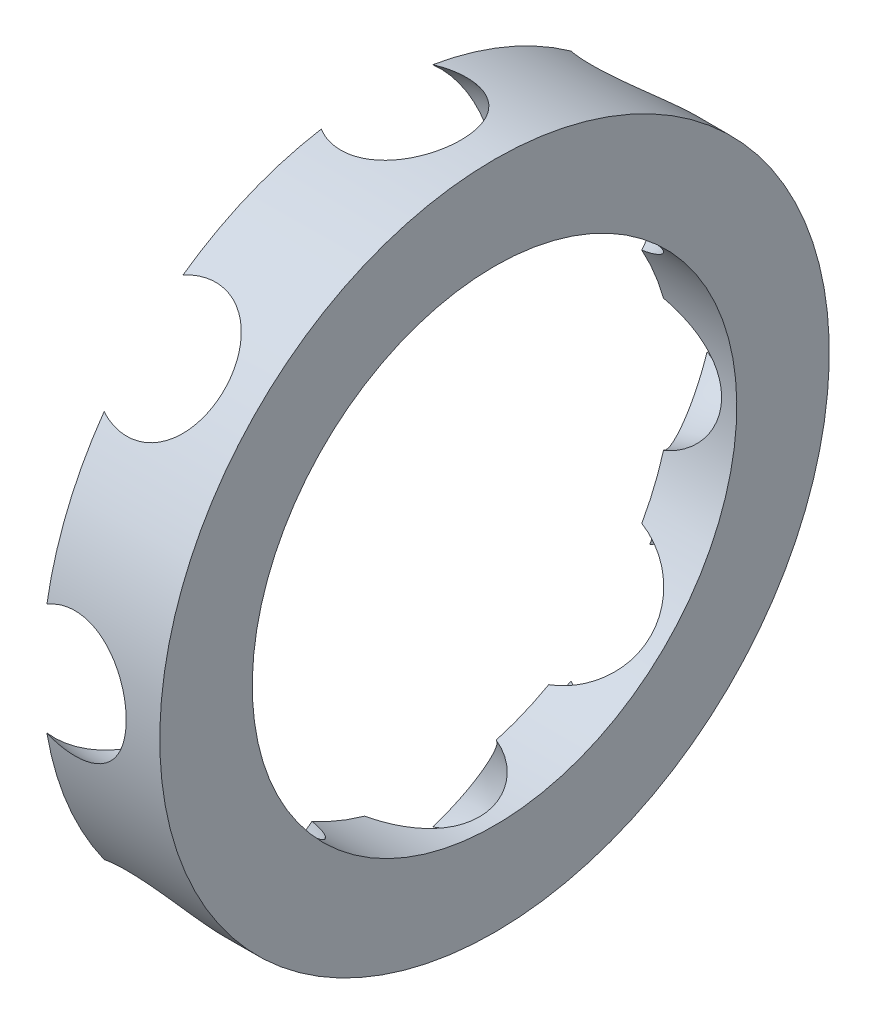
ISO-10303-21;
HEADER;
FILE_DESCRIPTION(('STEP AP214'),'2;1');
FILE_NAME('part.step','',(''),(''),'','','');
FILE_SCHEMA(('AUTOMOTIVE_DESIGN { 1 0 10303 214 1 1 1 1 }'));
ENDSEC;
DATA;
#1=APPLICATION_CONTEXT('core data for automotive mechanical design processes');
#2=APPLICATION_PROTOCOL_DEFINITION('international standard','automotive_design',2000,#1);
#3=PRODUCT_CONTEXT('',#1,'mechanical');
#4=PRODUCT('Part','Part','',(#3));
#5=PRODUCT_RELATED_PRODUCT_CATEGORY('part','',(#4));
#6=PRODUCT_DEFINITION_FORMATION('','',#4);
#7=PRODUCT_DEFINITION_CONTEXT('part definition',#1,'design');
#8=PRODUCT_DEFINITION('design','',#6,#7);
#9=PRODUCT_DEFINITION_SHAPE('','',#8);
#10=(LENGTH_UNIT() NAMED_UNIT(*) SI_UNIT(.MILLI.,.METRE.));
#11=(NAMED_UNIT(*) PLANE_ANGLE_UNIT() SI_UNIT($,.RADIAN.));
#12=(NAMED_UNIT(*) SI_UNIT($,.STERADIAN.) SOLID_ANGLE_UNIT());
#13=UNCERTAINTY_MEASURE_WITH_UNIT(LENGTH_MEASURE(1.E-05),#10,'distance_accuracy_value','');
#14=(GEOMETRIC_REPRESENTATION_CONTEXT(3) GLOBAL_UNCERTAINTY_ASSIGNED_CONTEXT((#13)) GLOBAL_UNIT_ASSIGNED_CONTEXT((#10,
#11,#12)) REPRESENTATION_CONTEXT('',''));
#15=CARTESIAN_POINT('',(0.,0.,0.));
#16=DIRECTION('',(0.,0.,1.));
#17=DIRECTION('',(1.,0.,0.));
#18=AXIS2_PLACEMENT_3D('',#15,#16,#17);
#19=DIRECTION('',(-0.499999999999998,0.86602540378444,0.));
#20=VECTOR('',#19,1.);
#21=CARTESIAN_POINT('',(4.5,10.48,0.));
#22=LINE('',#21,#20);
#23=CARTESIAN_POINT('',(10.5506308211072,0.,0.));
#24=DIRECTION('',(-1.,0.,0.));
#25=AXIS1_PLACEMENT('',#23,#24);
#26=SURFACE_OF_REVOLUTION('',#22,#25);
#27=CARTESIAN_POINT('',(3.53005154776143,9.90983909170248,-7.04703406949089));
#28=CARTESIAN_POINT('',(3.55352377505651,9.91718630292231,-6.96655508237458));
#29=CARTESIAN_POINT('',(3.57820272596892,9.92118712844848,-6.88612647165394));
#30=CARTESIAN_POINT('',(3.62987110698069,9.92253128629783,-6.72595793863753));
#31=CARTESIAN_POINT('',(3.65686055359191,9.91987457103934,-6.64621802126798));
#32=CARTESIAN_POINT('',(3.71309941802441,9.9079276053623,-6.4878673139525));
#33=CARTESIAN_POINT('',(3.74235298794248,9.89862489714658,-6.40925892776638));
#34=CARTESIAN_POINT('',(3.80294081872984,9.87348178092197,-6.25393930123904));
#35=CARTESIAN_POINT('',(3.8342749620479,9.85764174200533,-6.1772279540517));
#36=CARTESIAN_POINT('',(3.93125366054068,9.80047902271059,-5.95069552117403));
#37=CARTESIAN_POINT('',(3.99988177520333,9.74951214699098,-5.80445539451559));
#38=CARTESIAN_POINT('',(4.14354014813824,9.6237299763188,-5.5266663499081));
#39=CARTESIAN_POINT('',(4.21855020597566,9.54898801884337,-5.39507391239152));
#40=CARTESIAN_POINT('',(4.31498036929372,9.44268434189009,-5.2427074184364));
#41=CARTESIAN_POINT('',(4.33412213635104,9.42110430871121,-5.21324869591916));
#42=CARTESIAN_POINT('',(4.37267126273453,9.37671645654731,-5.15547656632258));
#43=CARTESIAN_POINT('',(4.39207864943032,9.35390851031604,-5.12716327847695));
#44=CARTESIAN_POINT('',(4.56939915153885,9.14132550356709,-4.87577296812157));
#45=CARTESIAN_POINT('',(4.73743365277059,8.91004480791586,-4.6894977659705));
#46=CARTESIAN_POINT('',(4.92469609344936,8.62289391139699,-4.5386191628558));
#47=CARTESIAN_POINT('',(4.9456044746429,8.59041467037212,-4.52257937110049));
#48=CARTESIAN_POINT('',(4.98737699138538,8.52470194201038,-4.49208809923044));
#49=CARTESIAN_POINT('',(5.00824114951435,8.49146912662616,-4.47763526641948));
#50=CARTESIAN_POINT('',(5.07068471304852,8.39076143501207,-4.43673275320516));
#51=CARTESIAN_POINT('',(5.11215176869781,8.32222125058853,-4.41270963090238));
#52=CARTESIAN_POINT('',(5.19436493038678,8.18293368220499,-4.37133361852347));
#53=CARTESIAN_POINT('',(5.23511225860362,8.11219074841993,-4.3539681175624));
#54=CARTESIAN_POINT('',(5.31562577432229,7.96884624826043,-4.32594515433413));
#55=CARTESIAN_POINT('',(5.35539207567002,7.89624489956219,-4.31528691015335));
#56=CARTESIAN_POINT('',(5.41994196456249,7.7752346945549,-4.30325077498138));
#57=CARTESIAN_POINT('',(5.44511396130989,7.72721931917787,-4.29993266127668));
#58=CARTESIAN_POINT('',(5.46994845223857,7.6789832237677,-4.29804800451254));
#59=B_SPLINE_CURVE_WITH_KNOTS('',3,(#27,#28,#29,#30,#31,#32,#33,#34,#35,#36,#37,#38,#39,#40,#41,
#42,#43,#44,#45,#46,#47,#48,#49,#50,#51,#52,#53,#54,#55,#56,#57,#58),.UNSPECIFIED.,.F.,.F.,(4,2,
2,2,2,2,2,2,2,2,2,2,2,2,2,4),(0.,0.252379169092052,0.504760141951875,0.757615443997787,
1.010456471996,1.51607350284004,2.02014577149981,2.14380281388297,2.26747269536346,
3.26461226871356,3.39012134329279,3.51552259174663,3.76610652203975,4.01621342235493,
4.26629116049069,4.42915088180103),.UNSPECIFIED.);
#60=CARTESIAN_POINT('',(3.53005154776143,9.90983909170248,-7.04703406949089));
#61=VERTEX_POINT('',#60);
#62=CARTESIAN_POINT('',(5.46994845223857,7.6789832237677,-4.29804800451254));
#63=VERTEX_POINT('',#62);
#64=EDGE_CURVE('E11',#61,#63,#59,.T.);
#65=ORIENTED_EDGE('',*,*,#64,.T.);
#66=CARTESIAN_POINT('',(5.46994845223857,0.,0.));
#67=DIRECTION('',(-1.,0.,0.));
#68=DIRECTION('',(0.,1.,0.));
#69=AXIS2_PLACEMENT_3D('',#66,#67,#68);
#70=CIRCLE('',#69,8.8);
#71=CARTESIAN_POINT('',(5.46994845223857,8.46904,-2.39068222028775));
#72=VERTEX_POINT('',#71);
#73=EDGE_CURVE('E384',#72,#63,#70,.T.);
#74=ORIENTED_EDGE('',*,*,#73,.F.);
#75=CARTESIAN_POINT('',(5.46994845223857,8.46904,-2.39068222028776));
#76=CARTESIAN_POINT('',(5.43588049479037,8.51765916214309,-2.43563600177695));
#77=CARTESIAN_POINT('',(5.40120401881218,8.56785031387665,-2.47836804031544));
#78=CARTESIAN_POINT('',(5.3308592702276,8.67117135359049,-2.55918646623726));
#79=CARTESIAN_POINT('',(5.29519117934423,8.72430070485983,-2.59727369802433));
#80=CARTESIAN_POINT('',(5.18703734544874,8.88778686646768,-2.70426951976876));
#81=CARTESIAN_POINT('',(5.1133837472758,9.00226776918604,-2.76593627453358));
#82=CARTESIAN_POINT('',(4.99606122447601,9.1899134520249,-2.8469715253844));
#83=CARTESIAN_POINT('',(4.95269651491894,9.26039961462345,-2.87325514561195));
#84=CARTESIAN_POINT('',(4.86594460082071,9.40366916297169,-2.91855929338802));
#85=CARTESIAN_POINT('',(4.82255740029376,9.47645222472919,-2.93758084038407));
#86=CARTESIAN_POINT('',(4.73610623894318,9.62371805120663,-2.96819611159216));
#87=CARTESIAN_POINT('',(4.69304217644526,9.6982002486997,-2.97979227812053));
#88=CARTESIAN_POINT('',(4.60748750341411,9.84835331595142,-2.99549585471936));
#89=CARTESIAN_POINT('',(4.56499753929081,9.92402534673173,-2.99959542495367));
#90=CARTESIAN_POINT('',(4.43687321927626,10.1554286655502,-3.00056073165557));
#91=CARTESIAN_POINT('',(4.35258946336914,10.312123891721,-2.98537769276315));
#92=CARTESIAN_POINT('',(4.18987968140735,10.6223546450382,-2.92371829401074));
#93=CARTESIAN_POINT('',(4.1114534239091,10.775890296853,-2.87724317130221));
#94=CARTESIAN_POINT('',(4.00169855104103,10.9954432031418,-2.7870853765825));
#95=CARTESIAN_POINT('',(3.96736885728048,11.0648616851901,-2.7548880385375));
#96=CARTESIAN_POINT('',(3.90056534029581,11.2012492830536,-2.68415306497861));
#97=CARTESIAN_POINT('',(3.86808976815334,11.2682206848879,-2.64562154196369));
#98=CARTESIAN_POINT('',(3.80514065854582,11.3991889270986,-2.5625075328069));
#99=CARTESIAN_POINT('',(3.77466550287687,11.4631881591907,-2.51793002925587));
#100=CARTESIAN_POINT('',(3.71581558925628,11.5877790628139,-2.42301640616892));
#101=CARTESIAN_POINT('',(3.68744048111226,11.6483713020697,-2.37268125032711));
#102=CARTESIAN_POINT('',(3.63680120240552,11.7573022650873,-2.27418484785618));
#103=CARTESIAN_POINT('',(3.61424315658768,11.8061548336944,-2.22674048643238));
#104=CARTESIAN_POINT('',(3.57085204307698,11.9006687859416,-2.12820833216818));
#105=CARTESIAN_POINT('',(3.55001610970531,11.9463354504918,-2.07712686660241));
#106=CARTESIAN_POINT('',(3.53005154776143,11.99032,-2.02430884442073));
#107=B_SPLINE_CURVE_WITH_KNOTS('',3,(#75,#76,#77,#78,#79,#80,#81,#82,#83,#84,#85,#86,#87,#88,
#89,#90,#91,#92,#93,#94,#95,#96,#97,#98,#99,#100,#101,#102,#103,#104,#105,#106),.UNSPECIFIED.,
.F.,.F.,(4,2,2,2,2,2,2,2,2,2,2,2,2,2,2,4),(0.,0.223274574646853,0.446508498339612,
0.892857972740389,1.15307583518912,1.41325715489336,1.67335285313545,1.9337204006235,
2.46637936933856,2.99901728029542,3.2503852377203,3.50151203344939,3.75243311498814,
4.00331225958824,4.21834750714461,4.43301740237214),.UNSPECIFIED.);
#108=CARTESIAN_POINT('',(3.53005154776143,11.99032,-2.02430884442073));
#109=VERTEX_POINT('',#108);
#110=EDGE_CURVE('E34',#72,#109,#107,.T.);
#111=ORIENTED_EDGE('',*,*,#110,.T.);
#112=CARTESIAN_POINT('',(3.53005154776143,0.,0.));
#113=DIRECTION('',(-1.,0.,0.));
#114=DIRECTION('',(0.,1.,0.));
#115=AXIS2_PLACEMENT_3D('',#112,#113,#114);
#116=CIRCLE('',#115,12.16);
#117=EDGE_CURVE('E380',#109,#61,#116,.T.);
#118=ORIENTED_EDGE('',*,*,#117,.T.);
#119=EDGE_LOOP('',(#65,#74,#111,#118));
#120=FACE_BOUND('',#119,.T.);
#121=ADVANCED_FACE('F17',(#120),#26,.F.);
#122=CARTESIAN_POINT('',(7.8,10.48,0.));
#123=DIRECTION('',(1.,0.,0.));
#124=DIRECTION('',(0.,0.,-1.));
#125=AXIS2_PLACEMENT_3D('',#122,#123,#124);
#126=PLANE('',#125);
#127=CARTESIAN_POINT('',(7.8,0.,0.));
#128=DIRECTION('',(-1.,0.,0.));
#129=DIRECTION('',(0.,1.,0.));
#130=AXIS2_PLACEMENT_3D('',#127,#128,#129);
#131=CIRCLE('',#130,8.8);
#132=CARTESIAN_POINT('',(7.8,8.8,0.));
#133=VERTEX_POINT('',#132);
#134=EDGE_CURVE('E330',#133,#133,#131,.T.);
#135=ORIENTED_EDGE('',*,*,#134,.T.);
#136=EDGE_LOOP('',(#135));
#137=FACE_BOUND('',#136,.T.);
#138=CARTESIAN_POINT('',(7.8,0.,0.));
#139=DIRECTION('',(-1.,0.,0.));
#140=DIRECTION('',(0.,1.,0.));
#141=AXIS2_PLACEMENT_3D('',#138,#139,#140);
#142=CIRCLE('',#141,12.16);
#143=CARTESIAN_POINT('',(7.8,12.16,0.));
#144=VERTEX_POINT('',#143);
#145=EDGE_CURVE('E356',#144,#144,#142,.T.);
#146=ORIENTED_EDGE('',*,*,#145,.F.);
#147=EDGE_LOOP('',(#146));
#148=FACE_BOUND('',#147,.T.);
#149=ADVANCED_FACE('F347',(#137,#148),#126,.T.);
#150=DIRECTION('',(-0.499999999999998,0.86602540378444,0.));
#151=VECTOR('',#150,1.);
#152=CARTESIAN_POINT('',(4.5,10.48,0.));
#153=LINE('',#152,#151);
#154=CARTESIAN_POINT('',(10.5506308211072,0.,0.));
#155=DIRECTION('',(-1.,0.,0.));
#156=AXIS1_PLACEMENT('',#154,#155);
#157=SURFACE_OF_REVOLUTION('',#153,#156);
#158=CARTESIAN_POINT('',(5.46994845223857,7.6789832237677,4.29804800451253));
#159=CARTESIAN_POINT('',(5.43588304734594,7.74514556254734,4.30063657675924));
#160=CARTESIAN_POINT('',(5.40120332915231,7.81085773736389,4.30591293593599));
#161=CARTESIAN_POINT('',(5.33084901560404,7.94108059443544,4.32182970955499));
#162=CARTESIAN_POINT('',(5.29517451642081,8.00559139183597,4.33246960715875));
#163=CARTESIAN_POINT('',(5.18703314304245,8.19682932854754,4.37240637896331));
#164=CARTESIAN_POINT('',(5.11341603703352,8.32132456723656,4.4097227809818));
#165=CARTESIAN_POINT('',(4.95609571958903,8.57608112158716,4.51082669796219));
#166=CARTESIAN_POINT('',(4.87225570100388,8.70519922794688,4.57728380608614));
#167=CARTESIAN_POINT('',(4.70565671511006,8.94861068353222,4.73430723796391));
#168=CARTESIAN_POINT('',(4.62289770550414,9.06290461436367,4.82487261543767));
#169=CARTESIAN_POINT('',(4.46072750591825,9.27306360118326,5.02718432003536));
#170=CARTESIAN_POINT('',(4.38130902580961,9.36897060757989,5.13888124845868));
#171=CARTESIAN_POINT('',(4.22735312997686,9.53981623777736,5.38028724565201));
#172=CARTESIAN_POINT('',(4.15281698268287,9.61474942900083,5.51000096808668));
#173=CARTESIAN_POINT('',(4.00982743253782,9.74155655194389,5.78410661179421));
#174=CARTESIAN_POINT('',(3.94140120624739,9.79333120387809,5.92855852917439));
#175=CARTESIAN_POINT('',(3.81225245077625,9.87161708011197,6.22733410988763));
#176=CARTESIAN_POINT('',(3.75152336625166,9.89814992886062,6.38164920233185));
#177=CARTESIAN_POINT('',(3.6650688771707,9.91878771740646,6.62230393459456));
#178=CARTESIAN_POINT('',(3.63621307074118,9.92224001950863,6.70683207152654));
#179=CARTESIAN_POINT('',(3.58114515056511,9.9216486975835,6.87655495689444));
#180=CARTESIAN_POINT('',(3.55492847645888,9.91761824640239,6.96174827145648));
#181=CARTESIAN_POINT('',(3.53005154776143,9.90983909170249,7.04703406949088));
#182=B_SPLINE_CURVE_WITH_KNOTS('',3,(#158,#159,#160,#161,#162,#163,#164,#165,#166,#167,#168,
#169,#170,#171,#172,#173,#174,#175,#176,#177,#178,#179,#180,#181),.UNSPECIFIED.,.F.,.F.,(4,2,2,
2,2,2,2,2,2,2,2,4),(0.,0.223282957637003,0.446544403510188,0.892858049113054,1.39350726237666,
1.89413682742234,2.39361022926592,2.89321288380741,3.3949372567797,3.89623141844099,
4.16407053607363,4.43143858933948),.UNSPECIFIED.);
#183=CARTESIAN_POINT('',(5.46994845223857,7.6789832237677,4.29804800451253));
#184=VERTEX_POINT('',#183);
#185=CARTESIAN_POINT('',(3.53005154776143,9.90983909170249,7.04703406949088));
#186=VERTEX_POINT('',#185);
#187=EDGE_CURVE('E321',#184,#186,#182,.T.);
#188=ORIENTED_EDGE('',*,*,#187,.T.);
#189=CARTESIAN_POINT('',(3.53005154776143,0.,0.));
#190=DIRECTION('',(-1.,0.,0.));
#191=DIRECTION('',(0.,1.,0.));
#192=AXIS2_PLACEMENT_3D('',#189,#190,#191);
#193=CIRCLE('',#192,12.16);
#194=CARTESIAN_POINT('',(3.53005154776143,11.99032,2.02430884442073));
#195=VERTEX_POINT('',#194);
#196=EDGE_CURVE('E331',#186,#195,#193,.T.);
#197=ORIENTED_EDGE('',*,*,#196,.T.);
#198=CARTESIAN_POINT('',(3.53005154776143,11.99032,2.02430884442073));
#199=CARTESIAN_POINT('',(3.55353368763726,11.9385861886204,2.08643755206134));
#200=CARTESIAN_POINT('',(3.57822354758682,11.8845198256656,2.14616233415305));
#201=CARTESIAN_POINT('',(3.62991529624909,11.7721639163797,2.26041202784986));
#202=CARTESIAN_POINT('',(3.65691716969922,11.7138743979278,2.31493697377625));
#203=CARTESIAN_POINT('',(3.71315937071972,11.5934501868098,2.41845014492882));
#204=CARTESIAN_POINT('',(3.74240201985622,11.5313115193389,2.46743249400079));
#205=CARTESIAN_POINT('',(3.80296629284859,11.4037556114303,2.55943806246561));
#206=CARTESIAN_POINT('',(3.83428782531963,11.3383385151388,2.60246154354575));
#207=CARTESIAN_POINT('',(3.93122888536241,11.1378135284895,2.72217720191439));
#208=CARTESIAN_POINT('',(3.99983133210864,10.9984180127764,2.78952652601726));
#209=CARTESIAN_POINT('',(4.14347720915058,10.7130711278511,2.89702645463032));
#210=CARTESIAN_POINT('',(4.21850566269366,10.5671353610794,2.93723846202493));
#211=CARTESIAN_POINT('',(4.33280448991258,10.3503299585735,2.97585611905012));
#212=CARTESIAN_POINT('',(4.37017788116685,10.280256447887,2.98512676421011));
#213=CARTESIAN_POINT('',(4.44587807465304,10.140060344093,2.9973057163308));
#214=CARTESIAN_POINT('',(4.48420503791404,10.0699377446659,3.00021294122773));
#215=CARTESIAN_POINT('',(4.60891742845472,9.84471491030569,2.99924495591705));
#216=CARTESIAN_POINT('',(4.69687318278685,9.69034113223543,2.98276343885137));
#217=CARTESIAN_POINT('',(4.87418234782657,9.38873544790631,2.91857504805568));
#218=CARTESIAN_POINT('',(4.96353825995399,9.24151887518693,2.87080405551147));
#219=CARTESIAN_POINT('',(5.12408362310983,8.98554690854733,2.75724030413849));
#220=CARTESIAN_POINT('',(5.19555726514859,8.87473453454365,2.69646037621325));
#221=CARTESIAN_POINT('',(5.30049519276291,8.71638280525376,2.59167189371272));
#222=CARTESIAN_POINT('',(5.33506707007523,8.66495077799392,2.55451032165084));
#223=CARTESIAN_POINT('',(5.40326862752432,8.56486205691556,2.47582287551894));
#224=CARTESIAN_POINT('',(5.43689818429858,8.51620572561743,2.43429643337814));
#225=CARTESIAN_POINT('',(5.46994845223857,8.46904,2.39068222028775));
#226=B_SPLINE_CURVE_WITH_KNOTS('',3,(#198,#199,#200,#201,#202,#203,#204,#205,#206,#207,#208,
#209,#210,#211,#212,#213,#214,#215,#216,#217,#218,#219,#220,#221,#222,#223,#224,#225),
.UNSPECIFIED.,.F.,.F.,(4,2,2,2,2,2,2,2,2,2,2,2,2,4),(0.,0.252485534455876,0.504969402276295,
0.757718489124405,1.01045647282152,1.51587485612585,2.02014577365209,2.25978870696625,
2.49947238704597,3.03164999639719,3.56492157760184,3.99888404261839,4.21549408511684,
4.43213235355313),.UNSPECIFIED.);
#227=CARTESIAN_POINT('',(5.46994845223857,8.46904,2.39068222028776));
#228=VERTEX_POINT('',#227);
#229=EDGE_CURVE('E336',#195,#228,#226,.T.);
#230=ORIENTED_EDGE('',*,*,#229,.T.);
#231=CARTESIAN_POINT('',(5.46994845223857,0.,0.));
#232=DIRECTION('',(-1.,0.,0.));
#233=DIRECTION('',(0.,1.,0.));
#234=AXIS2_PLACEMENT_3D('',#231,#232,#233);
#235=CIRCLE('',#234,8.8);
#236=EDGE_CURVE('E390',#184,#228,#235,.T.);
#237=ORIENTED_EDGE('',*,*,#236,.F.);
#238=EDGE_LOOP('',(#188,#197,#230,#237));
#239=FACE_BOUND('',#238,.T.);
#240=ADVANCED_FACE('F341',(#239),#157,.F.);
#241=DIRECTION('',(-0.499999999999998,0.86602540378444,0.));
#242=VECTOR('',#241,1.);
#243=CARTESIAN_POINT('',(4.5,10.48,0.));
#244=LINE('',#243,#242);
#245=CARTESIAN_POINT('',(10.5506308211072,0.,0.));
#246=DIRECTION('',(-1.,0.,0.));
#247=AXIS1_PLACEMENT('',#245,#246);
#248=SURFACE_OF_REVOLUTION('',#244,#247);
#249=CARTESIAN_POINT('',(3.53005154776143,2.02430884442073,-11.99032));
#250=CARTESIAN_POINT('',(3.55355295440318,2.08648836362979,-11.9385437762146));
#251=CARTESIAN_POINT('',(3.57826396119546,2.14626002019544,-11.8844313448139));
#252=CARTESIAN_POINT('',(3.63000094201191,2.26059295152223,-11.7719784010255));
#253=CARTESIAN_POINT('',(3.65702683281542,2.31515441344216,-11.7136380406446));
#254=CARTESIAN_POINT('',(3.7132754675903,2.41864814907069,-11.5932031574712));
#255=CARTESIAN_POINT('',(3.74249698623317,2.46758352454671,-11.5311107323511));
#256=CARTESIAN_POINT('',(3.80301536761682,2.55950582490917,-11.4036530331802));
#257=CARTESIAN_POINT('',(3.83431219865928,2.60249284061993,-11.3382878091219));
#258=CARTESIAN_POINT('',(3.93116697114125,2.72209834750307,-11.1379421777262));
#259=CARTESIAN_POINT('',(3.99970719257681,2.78939455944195,-10.9986729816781));
#260=CARTESIAN_POINT('',(4.1433153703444,2.89694429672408,-10.7133842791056));
#261=CARTESIAN_POINT('',(4.21838144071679,2.93720560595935,-10.5673667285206));
#262=CARTESIAN_POINT('',(4.37331856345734,2.9895353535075,-10.2734859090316));
#263=CARTESIAN_POINT('',(4.45317205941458,3.0017010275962,-10.1256307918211));
#264=CARTESIAN_POINT('',(4.61615607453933,2.99774914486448,-9.83204616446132));
#265=CARTESIAN_POINT('',(4.6992877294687,2.98162169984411,-9.6863174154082));
#266=CARTESIAN_POINT('',(4.86627205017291,2.92169758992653,-9.40211032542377));
#267=CARTESIAN_POINT('',(4.95011925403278,2.87803567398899,-9.26360021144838));
#268=CARTESIAN_POINT('',(5.11649056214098,2.76441090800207,-8.99710676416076));
#269=CARTESIAN_POINT('',(5.19901620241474,2.69448131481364,-8.86911036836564));
#270=CARTESIAN_POINT('',(5.31202935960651,2.57936001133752,-8.69919656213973));
#271=CARTESIAN_POINT('',(5.34425091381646,2.54422192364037,-8.65139402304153));
#272=CARTESIAN_POINT('',(5.40779636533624,2.47021820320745,-8.55831556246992));
#273=CARTESIAN_POINT('',(5.43912177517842,2.43135939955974,-8.51303524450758));
#274=CARTESIAN_POINT('',(5.46994845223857,2.39068222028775,-8.46904));
#275=B_SPLINE_CURVE_WITH_KNOTS('',3,(#249,#250,#251,#252,#253,#254,#255,#256,#257,#258,#259,
#260,#261,#262,#263,#264,#265,#266,#267,#268,#269,#270,#271,#272,#273,#274),.UNSPECIFIED.,.F.,
.F.,(4,2,2,2,2,2,2,2,2,2,2,2,4),(0.,0.252691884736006,0.505374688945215,0.757917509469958,
1.01045647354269,1.51537384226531,2.02014577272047,2.5231681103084,3.0263662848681,
3.52712080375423,4.02724345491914,4.22965771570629,4.43170733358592),.UNSPECIFIED.);
#276=CARTESIAN_POINT('',(3.53005154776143,2.02430884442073,-11.99032));
#277=VERTEX_POINT('',#276);
#278=CARTESIAN_POINT('',(5.46994845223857,2.39068222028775,-8.46904));
#279=VERTEX_POINT('',#278);
#280=EDGE_CURVE('E502',#277,#279,#275,.T.);
#281=ORIENTED_EDGE('',*,*,#280,.T.);
#282=CARTESIAN_POINT('',(5.46994845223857,0.,0.));
#283=DIRECTION('',(-1.,0.,0.));
#284=DIRECTION('',(0.,1.,0.));
#285=AXIS2_PLACEMENT_3D('',#282,#283,#284);
#286=CIRCLE('',#285,8.8);
#287=CARTESIAN_POINT('',(5.46994845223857,4.29804800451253,-7.6789832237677));
#288=VERTEX_POINT('',#287);
#289=EDGE_CURVE('E403',#288,#279,#286,.T.);
#290=ORIENTED_EDGE('',*,*,#289,.F.);
#291=CARTESIAN_POINT('',(5.46994845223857,4.29804800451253,-7.6789832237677));
#292=CARTESIAN_POINT('',(5.43585115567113,4.3006336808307,-7.74520878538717));
#293=CARTESIAN_POINT('',(5.40112582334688,4.30592238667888,-7.81100503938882));
#294=CARTESIAN_POINT('',(5.33066429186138,4.32187960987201,-7.9414186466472));
#295=CARTESIAN_POINT('',(5.29492779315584,4.33254973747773,-8.00603564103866));
#296=CARTESIAN_POINT('',(5.22280130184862,4.35920817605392,-8.13356868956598));
#297=CARTESIAN_POINT('',(5.1864131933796,4.37518295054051,-8.19648863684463));
#298=CARTESIAN_POINT('',(5.1131514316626,4.41237449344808,-8.32043630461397));
#299=CARTESIAN_POINT('',(5.07627794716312,4.43358948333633,-8.38146465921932));
#300=CARTESIAN_POINT('',(4.99827156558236,4.48372247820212,-8.50778308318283));
#301=CARTESIAN_POINT('',(4.95710796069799,4.51322429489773,-8.57282347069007));
#302=CARTESIAN_POINT('',(4.87477413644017,4.57831399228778,-8.69971767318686));
#303=CARTESIAN_POINT('',(4.83360393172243,4.61389868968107,-8.7615731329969));
#304=CARTESIAN_POINT('',(4.75158225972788,4.6908525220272,-8.88160079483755));
#305=CARTESIAN_POINT('',(4.71073035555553,4.732211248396,-8.93977935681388));
#306=CARTESIAN_POINT('',(4.62950949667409,4.82047915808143,-9.05219125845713));
#307=CARTESIAN_POINT('',(4.58914095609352,4.86739277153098,-9.1064213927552));
#308=CARTESIAN_POINT('',(4.46811194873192,5.01725222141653,-9.26389871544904));
#309=CARTESIAN_POINT('',(4.388551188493,5.1283550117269,-9.36043226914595));
#310=CARTESIAN_POINT('',(4.23420908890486,5.36877848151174,-9.53266639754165));
#311=CARTESIAN_POINT('',(4.15943516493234,5.4981264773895,-9.60833522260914));
#312=CARTESIAN_POINT('',(4.01600045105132,5.77152721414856,-9.73658248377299));
#313=CARTESIAN_POINT('',(3.94736035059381,5.91562644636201,-9.78908496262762));
#314=CARTESIAN_POINT('',(3.81776997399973,6.21378968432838,-9.86885134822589));
#315=CARTESIAN_POINT('',(3.75681146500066,6.36784274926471,-9.8961424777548));
#316=CARTESIAN_POINT('',(3.66913220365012,6.61055085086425,-9.91817857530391));
#317=CARTESIAN_POINT('',(3.63936401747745,6.69738438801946,-9.92204881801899));
#318=CARTESIAN_POINT('',(3.58261181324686,6.87179217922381,-9.92187143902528));
#319=CARTESIAN_POINT('',(3.55562333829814,6.95936499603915,-9.91783670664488));
#320=CARTESIAN_POINT('',(3.53005154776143,7.04703406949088,-9.90983909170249));
#321=B_SPLINE_CURVE_WITH_KNOTS('',3,(#291,#292,#293,#294,#295,#296,#297,#298,#299,#300,#301,
#302,#303,#304,#305,#306,#307,#308,#309,#310,#311,#312,#313,#314,#315,#316,#317,#318,#319,#320),
.UNSPECIFIED.,.F.,.F.,(4,2,2,2,2,2,2,2,2,2,2,2,2,2,4),(0.,0.223545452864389,0.447157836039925,
0.670203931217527,0.893174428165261,1.14017848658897,1.38705367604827,1.63348944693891,
1.8801230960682,2.37947915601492,2.87959093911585,3.38133050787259,3.88252767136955,
4.15781128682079,4.4326464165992),.UNSPECIFIED.);
#322=CARTESIAN_POINT('',(3.53005154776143,7.04703406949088,-9.90983909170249));
#323=VERTEX_POINT('',#322);
#324=EDGE_CURVE('E402',#288,#323,#321,.T.);
#325=ORIENTED_EDGE('',*,*,#324,.T.);
#326=CARTESIAN_POINT('',(3.53005154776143,0.,0.));
#327=DIRECTION('',(-1.,0.,0.));
#328=DIRECTION('',(0.,1.,0.));
#329=AXIS2_PLACEMENT_3D('',#326,#327,#328);
#330=CIRCLE('',#329,12.16);
#331=EDGE_CURVE('E398',#323,#277,#330,.T.);
#332=ORIENTED_EDGE('',*,*,#331,.T.);
#333=EDGE_LOOP('',(#281,#290,#325,#332));
#334=FACE_BOUND('',#333,.T.);
#335=ADVANCED_FACE('F346',(#334),#248,.F.);
#336=DIRECTION('',(-0.499999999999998,0.86602540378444,0.));
#337=VECTOR('',#336,1.);
#338=CARTESIAN_POINT('',(4.5,10.48,0.));
#339=LINE('',#338,#337);
#340=CARTESIAN_POINT('',(10.5506308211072,0.,0.));
#341=DIRECTION('',(-1.,0.,0.));
#342=AXIS1_PLACEMENT('',#340,#341);
#343=SURFACE_OF_REVOLUTION('',#339,#342);
#344=CARTESIAN_POINT('',(3.53005154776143,-7.04703406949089,-9.90983909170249));
#345=CARTESIAN_POINT('',(3.55355295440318,-6.96645519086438,-9.91719533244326));
#346=CARTESIAN_POINT('',(3.57826396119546,-6.88592697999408,-9.92119700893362));
#347=CARTESIAN_POINT('',(3.63000094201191,-6.72556514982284,-9.9225263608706));
#348=CARTESIAN_POINT('',(3.65702683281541,-6.64573150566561,-9.91985427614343));
#349=CARTESIAN_POINT('',(3.7132754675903,-6.48739006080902,-9.90787507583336));
#350=CARTESIAN_POINT('',(3.74249698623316,-6.40888155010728,-9.89857163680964));
#351=CARTESIAN_POINT('',(3.80301536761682,-6.25375646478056,-9.87344431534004));
#352=CARTESIAN_POINT('',(3.83431219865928,-6.1771398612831,-9.85762053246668));
#353=CARTESIAN_POINT('',(3.93116697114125,-5.95090024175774,-9.80052864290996));
#354=CARTESIAN_POINT('',(3.99970719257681,-5.80483644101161,-9.74963605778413));
#355=CARTESIAN_POINT('',(4.1433153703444,-5.52705771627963,-9.6239556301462));
#356=CARTESIAN_POINT('',(4.21838144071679,-5.39533867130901,-9.54917467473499));
#357=CARTESIAN_POINT('',(4.37331856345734,-5.15053083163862,-9.37837227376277));
#358=CARTESIAN_POINT('',(4.45317205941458,-5.03737904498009,-9.2824253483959));
#359=CARTESIAN_POINT('',(4.61615607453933,-4.83257776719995,-9.07203526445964));
#360=CARTESIAN_POINT('',(4.6992877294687,-4.74093580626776,-8.95758565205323));
#361=CARTESIAN_POINT('',(4.86627205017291,-4.58234379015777,-8.71424814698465));
#362=CARTESIAN_POINT('',(4.95011925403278,-4.51527598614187,-8.58543306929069));
#363=CARTESIAN_POINT('',(5.11649056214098,-4.40718150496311,-8.31664890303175));
#364=CARTESIAN_POINT('',(5.19901620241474,-4.36612207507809,-8.17669409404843));
#365=CARTESIAN_POINT('',(5.31202935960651,-4.32737792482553,-7.97514383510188));
#366=CARTESIAN_POINT('',(5.34425091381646,-4.31842280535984,-7.91649595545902));
#367=CARTESIAN_POINT('',(5.40779636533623,-4.30493492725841,-7.79835101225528));
#368=CARTESIAN_POINT('',(5.43912177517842,-4.30039423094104,-7.73885566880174));
#369=CARTESIAN_POINT('',(5.46994845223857,-4.29804800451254,-7.6789832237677));
#370=B_SPLINE_CURVE_WITH_KNOTS('',3,(#344,#345,#346,#347,#348,#349,#350,#351,#352,#353,#354,
#355,#356,#357,#358,#359,#360,#361,#362,#363,#364,#365,#366,#367,#368,#369),.UNSPECIFIED.,.F.,
.F.,(4,2,2,2,2,2,2,2,2,2,2,2,4),(0.,0.252691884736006,0.505374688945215,0.757917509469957,
1.01045647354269,1.51537384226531,2.02014577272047,2.5231681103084,3.0263662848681,
3.52712080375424,4.02724345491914,4.22965771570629,4.43170733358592),.UNSPECIFIED.);
#371=CARTESIAN_POINT('',(3.53005154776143,-7.04703406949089,-9.90983909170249));
#372=VERTEX_POINT('',#371);
#373=CARTESIAN_POINT('',(5.46994845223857,-4.29804800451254,-7.6789832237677));
#374=VERTEX_POINT('',#373);
#375=EDGE_CURVE('E229',#372,#374,#370,.T.);
#376=ORIENTED_EDGE('',*,*,#375,.T.);
#377=CARTESIAN_POINT('',(5.46994845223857,0.,0.));
#378=DIRECTION('',(-1.,0.,0.));
#379=DIRECTION('',(0.,1.,0.));
#380=AXIS2_PLACEMENT_3D('',#377,#378,#379);
#381=CIRCLE('',#380,8.8);
#382=CARTESIAN_POINT('',(5.46994845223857,-2.39068222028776,-8.46904));
#383=VERTEX_POINT('',#382);
#384=EDGE_CURVE('E412',#383,#374,#381,.T.);
#385=ORIENTED_EDGE('',*,*,#384,.F.);
#386=CARTESIAN_POINT('',(5.46994845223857,-2.39068222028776,-8.46904));
#387=CARTESIAN_POINT('',(5.43588304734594,-2.43563566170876,-8.51765423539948));
#388=CARTESIAN_POINT('',(5.40120332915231,-2.47837023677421,-8.56785070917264));
#389=CARTESIAN_POINT('',(5.33084901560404,-2.55919684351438,-8.67118703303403));
#390=CARTESIAN_POINT('',(5.29517451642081,-2.59728932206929,-8.72432659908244));
#391=CARTESIAN_POINT('',(5.18703314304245,-2.70427540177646,-8.88779180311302));
#392=CARTESIAN_POINT('',(5.11341603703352,-2.76592014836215,-9.00220991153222));
#393=CARTESIAN_POINT('',(4.95609571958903,-2.87456897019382,-9.25384126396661));
#394=CARTESIAN_POINT('',(4.87225570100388,-2.91887698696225,-9.39213382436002));
#395=CARTESIAN_POINT('',(4.70565671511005,-2.97996254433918,-9.67528404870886));
#396=CARTESIAN_POINT('',(4.62289770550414,-2.99674116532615,-9.82014145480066));
#397=CARTESIAN_POINT('',(4.46072750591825,-3.00229003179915,-10.1118022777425));
#398=CARTESIAN_POINT('',(4.3813090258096,-2.99112487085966,-10.2586004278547));
#399=CARTESIAN_POINT('',(4.22735312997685,-2.94123115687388,-10.5501063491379));
#400=CARTESIAN_POINT('',(4.15281698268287,-2.90249547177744,-10.6948135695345));
#401=CARTESIAN_POINT('',(4.00982743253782,-2.79833968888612,-10.9783017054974));
#402=CARTESIAN_POINT('',(3.94140120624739,-2.73280696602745,-11.1170548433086));
#403=CARTESIAN_POINT('',(3.81225245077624,-2.57689720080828,-11.38367755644));
#404=CARTESIAN_POINT('',(3.75152336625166,-2.48654150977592,-11.5115563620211));
#405=CARTESIAN_POINT('',(3.6650688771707,-2.33096603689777,-11.6963180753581));
#406=CARTESIAN_POINT('',(3.63621307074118,-2.27363676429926,-11.7585296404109));
#407=CARTESIAN_POINT('',(3.58114515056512,-2.15320643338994,-11.878123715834));
#408=CARTESIAN_POINT('',(3.55492847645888,-2.09011570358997,-11.9355145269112));
#409=CARTESIAN_POINT('',(3.53005154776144,-2.02430884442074,-11.99032));
#410=B_SPLINE_CURVE_WITH_KNOTS('',3,(#386,#387,#388,#389,#390,#391,#392,#393,#394,#395,#396,
#397,#398,#399,#400,#401,#402,#403,#404,#405,#406,#407,#408,#409),.UNSPECIFIED.,.F.,.F.,(4,2,2,
2,2,2,2,2,2,2,2,4),(0.,0.223282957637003,0.446544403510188,0.892858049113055,1.39350726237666,
1.89413682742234,2.39361022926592,2.89321288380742,3.3949372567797,3.89623141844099,
4.16407053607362,4.43143858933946),.UNSPECIFIED.);
#411=CARTESIAN_POINT('',(3.53005154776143,-2.02430884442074,-11.99032));
#412=VERTEX_POINT('',#411);
#413=EDGE_CURVE('E411',#383,#412,#410,.T.);
#414=ORIENTED_EDGE('',*,*,#413,.T.);
#415=CARTESIAN_POINT('',(3.53005154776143,0.,0.));
#416=DIRECTION('',(-1.,0.,0.));
#417=DIRECTION('',(0.,1.,0.));
#418=AXIS2_PLACEMENT_3D('',#415,#416,#417);
#419=CIRCLE('',#418,12.16);
#420=EDGE_CURVE('E407',#412,#372,#419,.T.);
#421=ORIENTED_EDGE('',*,*,#420,.T.);
#422=EDGE_LOOP('',(#376,#385,#414,#421));
#423=FACE_BOUND('',#422,.T.);
#424=ADVANCED_FACE('F258',(#423),#343,.F.);
#425=DIRECTION('',(-0.499999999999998,0.86602540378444,0.));
#426=VECTOR('',#425,1.);
#427=CARTESIAN_POINT('',(4.5,10.48,0.));
#428=LINE('',#427,#426);
#429=CARTESIAN_POINT('',(10.5506308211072,0.,0.));
#430=DIRECTION('',(-1.,0.,0.));
#431=AXIS1_PLACEMENT('',#429,#430);
#432=SURFACE_OF_REVOLUTION('',#428,#431);
#433=CARTESIAN_POINT('',(3.53005154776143,-11.99032,-2.02430884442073));
#434=CARTESIAN_POINT('',(3.5581161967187,-11.9284923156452,-2.09855608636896));
#435=CARTESIAN_POINT('',(3.58789116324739,-11.8633623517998,-2.16934476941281));
#436=CARTESIAN_POINT('',(3.65077274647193,-11.7270664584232,-2.30351965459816));
#437=CARTESIAN_POINT('',(3.68388565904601,-11.6558891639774,-2.36689136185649));
#438=CARTESIAN_POINT('',(3.77643954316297,-11.4589585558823,-2.52510602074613));
#439=CARTESIAN_POINT('',(3.83867718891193,-11.3285427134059,-2.61265017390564));
#440=CARTESIAN_POINT('',(3.97074343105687,-11.0573721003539,-2.76228529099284));
#441=CARTESIAN_POINT('',(4.0405737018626,-10.9166150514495,-2.82437062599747));
#442=CARTESIAN_POINT('',(4.17763685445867,-10.6466323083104,-2.91544469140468));
#443=CARTESIAN_POINT('',(4.24415446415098,-10.5180834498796,-2.94753814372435));
#444=CARTESIAN_POINT('',(4.38098647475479,-10.2594486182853,-2.99004760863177));
#445=CARTESIAN_POINT('',(4.45130069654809,-10.1293627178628,-3.00046464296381));
#446=CARTESIAN_POINT('',(4.60902344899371,-9.8445213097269,-2.99924857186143));
#447=CARTESIAN_POINT('',(4.69701726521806,-9.6900872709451,-2.9827393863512));
#448=CARTESIAN_POINT('',(4.87430643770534,-9.38853316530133,-2.91850191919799));
#449=CARTESIAN_POINT('',(4.96360247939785,-9.24141714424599,-2.87075657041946));
#450=CARTESIAN_POINT('',(5.12404502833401,-8.98560790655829,-2.75726928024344));
#451=CARTESIAN_POINT('',(5.1954769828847,-8.87485884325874,-2.69652906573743));
#452=CARTESIAN_POINT('',(5.30039668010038,-8.71652987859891,-2.59177599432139));
#453=CARTESIAN_POINT('',(5.33498857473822,-8.66506682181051,-2.55459760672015));
#454=CARTESIAN_POINT('',(5.40322998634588,-8.56491791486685,-2.4758707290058));
#455=CARTESIAN_POINT('',(5.43687935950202,-8.51623248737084,-2.43432157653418));
#456=CARTESIAN_POINT('',(5.46994845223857,-8.46904,-2.39068222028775));
#457=B_SPLINE_CURVE_WITH_KNOTS('',3,(#433,#434,#435,#436,#437,#438,#439,#440,#441,#442,#443,
#444,#445,#446,#447,#448,#449,#450,#451,#452,#453,#454,#455,#456),.UNSPECIFIED.,.F.,.F.,(4,2,2,
2,2,2,2,2,2,2,2,4),(0.,0.301621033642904,0.603822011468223,1.10814077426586,1.61257098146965,
2.05571281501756,2.49883376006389,3.03141273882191,3.56428295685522,3.99800112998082,
4.21473123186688,4.43149422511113),.UNSPECIFIED.);
#458=CARTESIAN_POINT('',(3.53005154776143,-11.99032,-2.02430884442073));
#459=VERTEX_POINT('',#458);
#460=CARTESIAN_POINT('',(5.46994845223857,-8.46904,-2.39068222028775));
#461=VERTEX_POINT('',#460);
#462=EDGE_CURVE('E162',#459,#461,#457,.T.);
#463=ORIENTED_EDGE('',*,*,#462,.T.);
#464=CARTESIAN_POINT('',(5.46994845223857,0.,0.));
#465=DIRECTION('',(-1.,0.,0.));
#466=DIRECTION('',(0.,1.,0.));
#467=AXIS2_PLACEMENT_3D('',#464,#465,#466);
#468=CIRCLE('',#467,8.8);
#469=CARTESIAN_POINT('',(5.46994845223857,-7.6789832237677,-4.29804800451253));
#470=VERTEX_POINT('',#469);
#471=EDGE_CURVE('E418',#470,#461,#468,.T.);
#472=ORIENTED_EDGE('',*,*,#471,.F.);
#473=CARTESIAN_POINT('',(5.46994845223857,-7.6789832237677,-4.29804800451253));
#474=CARTESIAN_POINT('',(5.43588304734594,-7.74514556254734,-4.30063657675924));
#475=CARTESIAN_POINT('',(5.40120332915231,-7.81085773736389,-4.30591293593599));
#476=CARTESIAN_POINT('',(5.33084901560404,-7.94108059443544,-4.32182970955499));
#477=CARTESIAN_POINT('',(5.29517451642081,-8.00559139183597,-4.33246960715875));
#478=CARTESIAN_POINT('',(5.18703314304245,-8.19682932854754,-4.37240637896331));
#479=CARTESIAN_POINT('',(5.11341603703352,-8.32132456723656,-4.4097227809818));
#480=CARTESIAN_POINT('',(4.95609571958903,-8.57608112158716,-4.51082669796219));
#481=CARTESIAN_POINT('',(4.87225570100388,-8.70519922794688,-4.57728380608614));
#482=CARTESIAN_POINT('',(4.70565671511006,-8.94861068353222,-4.73430723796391));
#483=CARTESIAN_POINT('',(4.62289770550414,-9.06290461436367,-4.82487261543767));
#484=CARTESIAN_POINT('',(4.46072750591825,-9.27306360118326,-5.02718432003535));
#485=CARTESIAN_POINT('',(4.38130902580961,-9.36897060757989,-5.13888124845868));
#486=CARTESIAN_POINT('',(4.22735312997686,-9.53981623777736,-5.38028724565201));
#487=CARTESIAN_POINT('',(4.15281698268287,-9.61474942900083,-5.51000096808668));
#488=CARTESIAN_POINT('',(4.00982743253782,-9.74155655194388,-5.78410661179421));
#489=CARTESIAN_POINT('',(3.94140120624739,-9.79333120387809,-5.92855852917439));
#490=CARTESIAN_POINT('',(3.81225245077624,-9.87161708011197,-6.22733410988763));
#491=CARTESIAN_POINT('',(3.75152336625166,-9.89814992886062,-6.38164920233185));
#492=CARTESIAN_POINT('',(3.6650688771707,-9.91878771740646,-6.62230393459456));
#493=CARTESIAN_POINT('',(3.63621307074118,-9.92224001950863,-6.70683207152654));
#494=CARTESIAN_POINT('',(3.58114515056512,-9.9216486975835,-6.87655495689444));
#495=CARTESIAN_POINT('',(3.55492847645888,-9.91761824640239,-6.96174827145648));
#496=CARTESIAN_POINT('',(3.53005154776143,-9.90983909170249,-7.04703406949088));
#497=B_SPLINE_CURVE_WITH_KNOTS('',3,(#473,#474,#475,#476,#477,#478,#479,#480,#481,#482,#483,
#484,#485,#486,#487,#488,#489,#490,#491,#492,#493,#494,#495,#496),.UNSPECIFIED.,.F.,.F.,(4,2,2,
2,2,2,2,2,2,2,2,4),(0.,0.223282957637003,0.446544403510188,0.892858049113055,1.39350726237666,
1.89413682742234,2.39361022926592,2.89321288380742,3.3949372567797,3.89623141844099,
4.16407053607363,4.43143858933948),.UNSPECIFIED.);
#498=CARTESIAN_POINT('',(3.53005154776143,-9.90983909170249,-7.04703406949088));
#499=VERTEX_POINT('',#498);
#500=EDGE_CURVE('E237',#470,#499,#497,.T.);
#501=ORIENTED_EDGE('',*,*,#500,.T.);
#502=CARTESIAN_POINT('',(3.53005154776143,0.,0.));
#503=DIRECTION('',(-1.,0.,0.));
#504=DIRECTION('',(0.,1.,0.));
#505=AXIS2_PLACEMENT_3D('',#502,#503,#504);
#506=CIRCLE('',#505,12.16);
#507=EDGE_CURVE('E246',#499,#459,#506,.T.);
#508=ORIENTED_EDGE('',*,*,#507,.T.);
#509=EDGE_LOOP('',(#463,#472,#501,#508));
#510=FACE_BOUND('',#509,.T.);
#511=ADVANCED_FACE('F254',(#510),#432,.F.);
#512=DIRECTION('',(-0.499999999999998,0.86602540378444,0.));
#513=VECTOR('',#512,1.);
#514=CARTESIAN_POINT('',(4.5,10.48,0.));
#515=LINE('',#514,#513);
#516=CARTESIAN_POINT('',(10.5506308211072,0.,0.));
#517=DIRECTION('',(-1.,0.,0.));
#518=AXIS1_PLACEMENT('',#516,#517);
#519=SURFACE_OF_REVOLUTION('',#515,#518);
#520=CARTESIAN_POINT('',(3.53005154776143,-9.90983909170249,7.04703406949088));
#521=CARTESIAN_POINT('',(3.55352562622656,-9.9171868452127,6.9665487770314));
#522=CARTESIAN_POINT('',(3.57820657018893,-9.92118773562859,6.88611396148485));
#523=CARTESIAN_POINT('',(3.6298789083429,-9.92253098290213,6.72593434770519));
#524=CARTESIAN_POINT('',(3.65687028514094,-9.91987338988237,6.64618954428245));
#525=CARTESIAN_POINT('',(3.71310941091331,-9.90792459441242,6.48784025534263));
#526=CARTESIAN_POINT('',(3.74236100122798,-9.89862186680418,6.40923799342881));
#527=CARTESIAN_POINT('',(3.80294462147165,-9.87347990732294,6.25392994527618));
#528=CARTESIAN_POINT('',(3.83427656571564,-9.85764094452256,6.17722408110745));
#529=CARTESIAN_POINT('',(3.93124717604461,-9.80048254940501,5.95071092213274));
#530=CARTESIAN_POINT('',(3.99987078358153,-9.74951939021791,5.80447927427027));
#531=CARTESIAN_POINT('',(4.14351850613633,-9.62375129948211,5.52670558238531));
#532=CARTESIAN_POINT('',(4.21852396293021,-9.54901423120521,5.39512314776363));
#533=CARTESIAN_POINT('',(4.3339785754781,-9.4217422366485,5.21268509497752));
#534=CARTESIAN_POINT('',(4.37256331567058,-9.37729654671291,5.15485689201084));
#535=CARTESIAN_POINT('',(4.42140645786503,-9.31875052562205,5.08557815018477));
#536=CARTESIAN_POINT('',(4.43119971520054,-9.30689922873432,5.07188089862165));
#537=CARTESIAN_POINT('',(4.44593389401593,-9.28890135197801,5.05156360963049));
#538=CARTESIAN_POINT('',(4.45085256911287,-9.28286536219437,5.0448294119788));
#539=CARTESIAN_POINT('',(4.47548613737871,-9.25249775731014,5.01134478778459));
#540=CARTESIAN_POINT('',(4.49530967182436,-9.22761771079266,4.98516999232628));
#541=CARTESIAN_POINT('',(4.55523451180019,-9.15110031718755,4.90837398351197));
#542=CARTESIAN_POINT('',(4.59565217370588,-9.09774952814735,4.85967965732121));
#543=CARTESIAN_POINT('',(4.67710423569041,-8.98685929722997,4.76775674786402));
#544=CARTESIAN_POINT('',(4.71813935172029,-8.92931463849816,4.72453516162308));
#545=CARTESIAN_POINT('',(4.84224228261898,-8.75033791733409,4.60315283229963));
#546=CARTESIAN_POINT('',(4.92586870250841,-8.62312509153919,4.53383809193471));
#547=CARTESIAN_POINT('',(5.09214222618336,-8.35709155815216,4.42091381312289));
#548=CARTESIAN_POINT('',(5.1747889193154,-8.21826616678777,4.37731470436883));
#549=CARTESIAN_POINT('',(5.29225588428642,-8.0108441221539,4.33338342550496));
#550=CARTESIAN_POINT('',(5.32859406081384,-7.94520619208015,4.32242073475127));
#551=CARTESIAN_POINT('',(5.40014595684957,-7.81286077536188,4.3060750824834));
#552=CARTESIAN_POINT('',(5.43536238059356,-7.74615655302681,4.30067753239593));
#553=CARTESIAN_POINT('',(5.46994845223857,-7.6789832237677,4.29804800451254));
#554=B_SPLINE_CURVE_WITH_KNOTS('',3,(#520,#521,#522,#523,#524,#525,#526,#527,#528,#529,#530,
#531,#532,#533,#534,#535,#536,#537,#538,#539,#540,#541,#542,#543,#544,#545,#546,#547,#548,#549,
#550,#551,#552,#553),.UNSPECIFIED.,.F.,.F.,(4,2,2,2,2,2,2,2,2,2,2,2,2,2,2,2,4),(0.,
0.252398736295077,0.504795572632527,0.7576312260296,1.01045647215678,1.51601631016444,
2.02014577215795,2.267419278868,2.32918761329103,2.36007053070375,2.48362724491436,
2.73161389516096,2.97991446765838,3.47920809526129,3.97870408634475,4.20598231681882,
4.43266322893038),.UNSPECIFIED.);
#555=CARTESIAN_POINT('',(3.53005154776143,-9.90983909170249,7.04703406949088));
#556=VERTEX_POINT('',#555);
#557=CARTESIAN_POINT('',(5.46994845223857,-7.6789832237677,4.29804800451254));
#558=VERTEX_POINT('',#557);
#559=EDGE_CURVE('E157',#556,#558,#554,.T.);
#560=ORIENTED_EDGE('',*,*,#559,.T.);
#561=CARTESIAN_POINT('',(5.46994845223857,0.,0.));
#562=DIRECTION('',(-1.,0.,0.));
#563=DIRECTION('',(0.,1.,0.));
#564=AXIS2_PLACEMENT_3D('',#561,#562,#563);
#565=CIRCLE('',#564,8.8);
#566=CARTESIAN_POINT('',(5.46994845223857,-8.46904,2.39068222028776));
#567=VERTEX_POINT('',#566);
#568=EDGE_CURVE('E153',#567,#558,#565,.T.);
#569=ORIENTED_EDGE('',*,*,#568,.F.);
#570=CARTESIAN_POINT('',(5.46994845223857,-8.46904,2.39068222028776));
#571=CARTESIAN_POINT('',(5.43588049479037,-8.5176591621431,2.43563600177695));
#572=CARTESIAN_POINT('',(5.40120401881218,-8.56785031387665,2.47836804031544));
#573=CARTESIAN_POINT('',(5.3308592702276,-8.67117135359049,2.55918646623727));
#574=CARTESIAN_POINT('',(5.29519117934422,-8.72430070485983,2.59727369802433));
#575=CARTESIAN_POINT('',(5.18703734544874,-8.88778686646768,2.70426951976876));
#576=CARTESIAN_POINT('',(5.1133837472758,-9.00226776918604,2.76593627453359));
#577=CARTESIAN_POINT('',(4.99606122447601,-9.18991345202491,2.8469715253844));
#578=CARTESIAN_POINT('',(4.95269651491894,-9.26039961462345,2.87325514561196));
#579=CARTESIAN_POINT('',(4.86594460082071,-9.40366916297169,2.91855929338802));
#580=CARTESIAN_POINT('',(4.82255740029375,-9.47645222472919,2.93758084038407));
#581=CARTESIAN_POINT('',(4.73610623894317,-9.62371805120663,2.96819611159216));
#582=CARTESIAN_POINT('',(4.69304217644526,-9.6982002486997,2.97979227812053));
#583=CARTESIAN_POINT('',(4.60748750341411,-9.84835331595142,2.99549585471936));
#584=CARTESIAN_POINT('',(4.56499753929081,-9.92402534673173,2.99959542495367));
#585=CARTESIAN_POINT('',(4.43687321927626,-10.1554286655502,3.00056073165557));
#586=CARTESIAN_POINT('',(4.35258946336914,-10.312123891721,2.98537769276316));
#587=CARTESIAN_POINT('',(4.18987968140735,-10.6223546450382,2.92371829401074));
#588=CARTESIAN_POINT('',(4.1114534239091,-10.775890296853,2.87724317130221));
#589=CARTESIAN_POINT('',(4.00169855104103,-10.9954432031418,2.7870853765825));
#590=CARTESIAN_POINT('',(3.96736885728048,-11.0648616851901,2.75488803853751));
#591=CARTESIAN_POINT('',(3.90056534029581,-11.2012492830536,2.68415306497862));
#592=CARTESIAN_POINT('',(3.86808976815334,-11.2682206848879,2.64562154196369));
#593=CARTESIAN_POINT('',(3.80514065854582,-11.3991889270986,2.5625075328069));
#594=CARTESIAN_POINT('',(3.77466550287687,-11.4631881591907,2.51793002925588));
#595=CARTESIAN_POINT('',(3.71581558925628,-11.5877790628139,2.42301640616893));
#596=CARTESIAN_POINT('',(3.68744048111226,-11.6483713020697,2.37268125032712));
#597=CARTESIAN_POINT('',(3.63680120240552,-11.7573022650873,2.27418484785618));
#598=CARTESIAN_POINT('',(3.61424315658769,-11.8061548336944,2.22674048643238));
#599=CARTESIAN_POINT('',(3.57085204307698,-11.9006687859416,2.12820833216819));
#600=CARTESIAN_POINT('',(3.5500161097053,-11.9463354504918,2.07712686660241));
#601=CARTESIAN_POINT('',(3.53005154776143,-11.99032,2.02430884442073));
#602=B_SPLINE_CURVE_WITH_KNOTS('',3,(#570,#571,#572,#573,#574,#575,#576,#577,#578,#579,#580,
#581,#582,#583,#584,#585,#586,#587,#588,#589,#590,#591,#592,#593,#594,#595,#596,#597,#598,#599,
#600,#601),.UNSPECIFIED.,.F.,.F.,(4,2,2,2,2,2,2,2,2,2,2,2,2,2,2,4),(0.,0.223274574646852,
0.446508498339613,0.89285797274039,1.15307583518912,1.41325715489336,1.67335285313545,
1.9337204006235,2.46637936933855,2.99901728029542,3.25038523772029,3.50151203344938,
3.75243311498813,4.00331225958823,4.21834750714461,4.43301740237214),.UNSPECIFIED.);
#603=CARTESIAN_POINT('',(3.53005154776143,-11.99032,2.02430884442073));
#604=VERTEX_POINT('',#603);
#605=EDGE_CURVE('E147',#567,#604,#602,.T.);
#606=ORIENTED_EDGE('',*,*,#605,.T.);
#607=CARTESIAN_POINT('',(3.53005154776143,0.,0.));
#608=DIRECTION('',(-1.,0.,0.));
#609=DIRECTION('',(0.,1.,0.));
#610=AXIS2_PLACEMENT_3D('',#607,#608,#609);
#611=CIRCLE('',#610,12.16);
#612=EDGE_CURVE('E136',#604,#556,#611,.T.);
#613=ORIENTED_EDGE('',*,*,#612,.T.);
#614=EDGE_LOOP('',(#560,#569,#606,#613));
#615=FACE_BOUND('',#614,.T.);
#616=ADVANCED_FACE('F151',(#615),#519,.F.);
#617=DIRECTION('',(-0.499999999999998,0.86602540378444,0.));
#618=VECTOR('',#617,1.);
#619=CARTESIAN_POINT('',(4.5,10.48,0.));
#620=LINE('',#619,#618);
#621=CARTESIAN_POINT('',(10.5506308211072,0.,0.));
#622=DIRECTION('',(-1.,0.,0.));
#623=AXIS1_PLACEMENT('',#621,#622);
#624=SURFACE_OF_REVOLUTION('',#620,#623);
#625=CARTESIAN_POINT('',(3.53005154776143,-2.02430884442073,11.99032));
#626=CARTESIAN_POINT('',(3.55355295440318,-2.08648836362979,11.9385437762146));
#627=CARTESIAN_POINT('',(3.57826396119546,-2.14626002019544,11.8844313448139));
#628=CARTESIAN_POINT('',(3.63000094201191,-2.26059295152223,11.7719784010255));
#629=CARTESIAN_POINT('',(3.65702683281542,-2.31515441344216,11.7136380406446));
#630=CARTESIAN_POINT('',(3.7132754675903,-2.41864814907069,11.5932031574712));
#631=CARTESIAN_POINT('',(3.74249698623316,-2.46758352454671,11.5311107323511));
#632=CARTESIAN_POINT('',(3.80301536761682,-2.55950582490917,11.4036530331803));
#633=CARTESIAN_POINT('',(3.83431219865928,-2.60249284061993,11.3382878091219));
#634=CARTESIAN_POINT('',(3.93116697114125,-2.72209834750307,11.1379421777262));
#635=CARTESIAN_POINT('',(3.99970719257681,-2.78939455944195,10.9986729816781));
#636=CARTESIAN_POINT('',(4.1433153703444,-2.89694429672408,10.7133842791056));
#637=CARTESIAN_POINT('',(4.21838144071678,-2.93720560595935,10.5673667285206));
#638=CARTESIAN_POINT('',(4.37331856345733,-2.9895353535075,10.2734859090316));
#639=CARTESIAN_POINT('',(4.45317205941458,-3.0017010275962,10.1256307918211));
#640=CARTESIAN_POINT('',(4.61615607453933,-2.99774914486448,9.83204616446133));
#641=CARTESIAN_POINT('',(4.6992877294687,-2.98162169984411,9.6863174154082));
#642=CARTESIAN_POINT('',(4.86627205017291,-2.92169758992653,9.40211032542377));
#643=CARTESIAN_POINT('',(4.95011925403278,-2.87803567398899,9.26360021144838));
#644=CARTESIAN_POINT('',(5.11649056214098,-2.76441090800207,8.99710676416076));
#645=CARTESIAN_POINT('',(5.19901620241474,-2.69448131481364,8.86911036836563));
#646=CARTESIAN_POINT('',(5.31202935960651,-2.57936001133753,8.69919656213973));
#647=CARTESIAN_POINT('',(5.34425091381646,-2.54422192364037,8.65139402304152));
#648=CARTESIAN_POINT('',(5.40779636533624,-2.47021820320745,8.55831556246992));
#649=CARTESIAN_POINT('',(5.43912177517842,-2.43135939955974,8.51303524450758));
#650=CARTESIAN_POINT('',(5.46994845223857,-2.39068222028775,8.46904));
#651=B_SPLINE_CURVE_WITH_KNOTS('',3,(#625,#626,#627,#628,#629,#630,#631,#632,#633,#634,#635,
#636,#637,#638,#639,#640,#641,#642,#643,#644,#645,#646,#647,#648,#649,#650),.UNSPECIFIED.,.F.,
.F.,(4,2,2,2,2,2,2,2,2,2,2,2,4),(0.,0.252691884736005,0.505374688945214,0.757917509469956,
1.01045647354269,1.51537384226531,2.02014577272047,2.5231681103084,3.0263662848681,
3.52712080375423,4.02724345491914,4.22965771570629,4.43170733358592),.UNSPECIFIED.);
#652=CARTESIAN_POINT('',(3.53005154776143,-2.02430884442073,11.99032));
#653=VERTEX_POINT('',#652);
#654=CARTESIAN_POINT('',(5.46994845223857,-2.39068222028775,8.46904));
#655=VERTEX_POINT('',#654);
#656=EDGE_CURVE('E148',#653,#655,#651,.T.);
#657=ORIENTED_EDGE('',*,*,#656,.T.);
#658=CARTESIAN_POINT('',(5.46994845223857,0.,0.));
#659=DIRECTION('',(-1.,0.,0.));
#660=DIRECTION('',(0.,1.,0.));
#661=AXIS2_PLACEMENT_3D('',#658,#659,#660);
#662=CIRCLE('',#661,8.8);
#663=CARTESIAN_POINT('',(5.46994845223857,-4.29804800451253,7.6789832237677));
#664=VERTEX_POINT('',#663);
#665=EDGE_CURVE('E428',#664,#655,#662,.T.);
#666=ORIENTED_EDGE('',*,*,#665,.F.);
#667=CARTESIAN_POINT('',(5.46994845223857,-4.29804800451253,7.6789832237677));
#668=CARTESIAN_POINT('',(5.43585631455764,-4.30063329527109,7.74519876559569));
#669=CARTESIAN_POINT('',(5.40113633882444,-4.3059207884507,7.81098511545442));
#670=CARTESIAN_POINT('',(5.33068580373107,-4.32187395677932,7.94137929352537));
#671=CARTESIAN_POINT('',(5.29495494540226,-4.33254123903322,8.00598676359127));
#672=CARTESIAN_POINT('',(5.22282892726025,-4.35919643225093,8.13352070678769));
#673=CARTESIAN_POINT('',(5.18643542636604,-4.37517242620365,8.19645060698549));
#674=CARTESIAN_POINT('',(5.11316269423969,-4.41236801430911,8.3204176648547));
#675=CARTESIAN_POINT('',(5.07628363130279,-4.43358583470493,8.38145545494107));
#676=CARTESIAN_POINT('',(4.99826772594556,-4.48372494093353,8.50778930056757));
#677=CARTESIAN_POINT('',(4.95710017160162,-4.51322984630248,8.57283578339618));
#678=CARTESIAN_POINT('',(4.87476666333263,-4.57832050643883,8.69972888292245));
#679=CARTESIAN_POINT('',(4.83360072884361,-4.61390194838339,8.76157772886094));
#680=CARTESIAN_POINT('',(4.75164063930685,-4.69079749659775,8.88151545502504));
#681=CARTESIAN_POINT('',(4.71084572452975,-4.73209334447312,8.93961547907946));
#682=CARTESIAN_POINT('',(4.65005768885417,-4.7981444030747,9.02375408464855));
#683=CARTESIAN_POINT('',(4.62986887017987,-4.82083795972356,9.05128995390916));
#684=CARTESIAN_POINT('',(4.60473201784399,-4.85003685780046,9.08505828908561));
#685=CARTESIAN_POINT('',(4.59971036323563,-4.85591733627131,9.09177837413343));
#686=CARTESIAN_POINT('',(4.58967723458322,-4.86776104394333,9.10515291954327));
#687=CARTESIAN_POINT('',(4.58466576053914,-4.87372427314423,9.11180737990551));
#688=CARTESIAN_POINT('',(4.5596307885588,-4.90375055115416,9.14491935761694));
#689=CARTESIAN_POINT('',(4.53968660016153,-4.92842977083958,9.17087971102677));
#690=CARTESIAN_POINT('',(4.48000238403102,-5.00456564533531,9.24728808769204));
#691=CARTESIAN_POINT('',(4.44055627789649,-5.05795679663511,9.29606473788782));
#692=CARTESIAN_POINT('',(4.3626582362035,-5.16950222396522,9.38882143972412));
#693=CARTESIAN_POINT('',(4.3242073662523,-5.22766134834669,9.43279650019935));
#694=CARTESIAN_POINT('',(4.20972980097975,-5.41015945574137,9.5580127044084));
#695=CARTESIAN_POINT('',(4.13554740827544,-5.54127812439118,9.63129890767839));
#696=CARTESIAN_POINT('',(3.99356632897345,-5.81760316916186,9.75440921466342));
#697=CARTESIAN_POINT('',(3.92577934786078,-5.96283442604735,9.80419094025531));
#698=CARTESIAN_POINT('',(3.8300855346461,-6.18737507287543,9.85984107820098));
#699=CARTESIAN_POINT('',(3.79923209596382,-6.26320493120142,9.87521079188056));
#700=CARTESIAN_POINT('',(3.73955818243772,-6.41669291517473,9.89957312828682));
#701=CARTESIAN_POINT('',(3.71073779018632,-6.49435111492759,9.9085654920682));
#702=CARTESIAN_POINT('',(3.65528248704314,-6.65083913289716,9.92006379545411));
#703=CARTESIAN_POINT('',(3.62864577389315,-6.72966792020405,9.92257513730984));
#704=CARTESIAN_POINT('',(3.57763028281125,-6.88799275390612,9.92109365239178));
#705=CARTESIAN_POINT('',(3.55325152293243,-6.96748880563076,9.91710077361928));
#706=CARTESIAN_POINT('',(3.53005154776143,-7.04703406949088,9.90983909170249));
#707=B_SPLINE_CURVE_WITH_KNOTS('',3,(#667,#668,#669,#670,#671,#672,#673,#674,#675,#676,#677,
#678,#679,#680,#681,#682,#683,#684,#685,#686,#687,#688,#689,#690,#691,#692,#693,#694,#695,#696,
#697,#698,#699,#700,#701,#702,#703,#704,#705,#706),.UNSPECIFIED.,.F.,.F.,(4,2,2,2,2,2,2,2,2,2,2,
2,2,2,2,2,2,2,2,4),(0.,0.223511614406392,0.447090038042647,0.670169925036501,0.893174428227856,
1.1402013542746,1.38705367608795,1.63313473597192,1.7560956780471,1.78682972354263,
1.81756376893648,1.94052467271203,2.18733102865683,2.43439154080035,2.93446174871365,
3.43543016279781,3.68507901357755,3.93473800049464,4.18418881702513,4.4336416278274),.UNSPECIFIED.);
#708=CARTESIAN_POINT('',(3.53005154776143,-7.04703406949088,9.90983909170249));
#709=VERTEX_POINT('',#708);
#710=EDGE_CURVE('E288',#664,#709,#707,.T.);
#711=ORIENTED_EDGE('',*,*,#710,.T.);
#712=CARTESIAN_POINT('',(3.53005154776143,0.,0.));
#713=DIRECTION('',(-1.,0.,0.));
#714=DIRECTION('',(0.,1.,0.));
#715=AXIS2_PLACEMENT_3D('',#712,#713,#714);
#716=CIRCLE('',#715,12.16);
#717=EDGE_CURVE('E295',#709,#653,#716,.T.);
#718=ORIENTED_EDGE('',*,*,#717,.T.);
#719=EDGE_LOOP('',(#657,#666,#711,#718));
#720=FACE_BOUND('',#719,.T.);
#721=ADVANCED_FACE('F275',(#720),#624,.F.);
#722=DIRECTION('',(-0.499999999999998,0.86602540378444,0.));
#723=VECTOR('',#722,1.);
#724=CARTESIAN_POINT('',(4.5,10.48,0.));
#725=LINE('',#724,#723);
#726=CARTESIAN_POINT('',(10.5506308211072,0.,0.));
#727=DIRECTION('',(-1.,0.,0.));
#728=AXIS1_PLACEMENT('',#726,#727);
#729=SURFACE_OF_REVOLUTION('',#725,#728);
#730=CARTESIAN_POINT('',(3.53005154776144,7.04703406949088,9.90983909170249));
#731=CARTESIAN_POINT('',(3.55355295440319,6.96645519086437,9.91719533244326));
#732=CARTESIAN_POINT('',(3.57826396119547,6.88592697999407,9.92119700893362));
#733=CARTESIAN_POINT('',(3.63000094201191,6.72556514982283,9.9225263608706));
#734=CARTESIAN_POINT('',(3.65702683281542,6.6457315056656,9.91985427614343));
#735=CARTESIAN_POINT('',(3.71327546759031,6.48739006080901,9.90787507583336));
#736=CARTESIAN_POINT('',(3.74249698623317,6.40888155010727,9.89857163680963));
#737=CARTESIAN_POINT('',(3.80301536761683,6.25375646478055,9.87344431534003));
#738=CARTESIAN_POINT('',(3.83431219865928,6.17713986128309,9.85762053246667));
#739=CARTESIAN_POINT('',(3.93116697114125,5.95090024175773,9.80052864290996));
#740=CARTESIAN_POINT('',(3.99970719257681,5.80483644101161,9.74963605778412));
#741=CARTESIAN_POINT('',(4.1433153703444,5.52705771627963,9.6239556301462));
#742=CARTESIAN_POINT('',(4.21838144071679,5.395338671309,9.54917467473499));
#743=CARTESIAN_POINT('',(4.37331856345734,5.15053083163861,9.37837227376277));
#744=CARTESIAN_POINT('',(4.45317205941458,5.03737904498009,9.28242534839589));
#745=CARTESIAN_POINT('',(4.61615607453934,4.83257776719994,9.07203526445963));
#746=CARTESIAN_POINT('',(4.6992877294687,4.74093580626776,8.95758565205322));
#747=CARTESIAN_POINT('',(4.86627205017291,4.58234379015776,8.71424814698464));
#748=CARTESIAN_POINT('',(4.95011925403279,4.51527598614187,8.58543306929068));
#749=CARTESIAN_POINT('',(5.11649056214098,4.40718150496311,8.31664890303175));
#750=CARTESIAN_POINT('',(5.19901620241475,4.36612207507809,8.17669409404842));
#751=CARTESIAN_POINT('',(5.31202935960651,4.32737792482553,7.97514383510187));
#752=CARTESIAN_POINT('',(5.34425091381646,4.31842280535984,7.91649595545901));
#753=CARTESIAN_POINT('',(5.40779636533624,4.30493492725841,7.79835101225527));
#754=CARTESIAN_POINT('',(5.43912177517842,4.30039423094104,7.73885566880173));
#755=CARTESIAN_POINT('',(5.46994845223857,4.29804800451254,7.6789832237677));
#756=B_SPLINE_CURVE_WITH_KNOTS('',3,(#730,#731,#732,#733,#734,#735,#736,#737,#738,#739,#740,
#741,#742,#743,#744,#745,#746,#747,#748,#749,#750,#751,#752,#753,#754,#755),.UNSPECIFIED.,.F.,
.F.,(4,2,2,2,2,2,2,2,2,2,2,2,4),(0.,0.252691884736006,0.505374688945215,0.757917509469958,
1.01045647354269,1.51537384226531,2.02014577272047,2.52316811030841,3.0263662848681,
3.52712080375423,4.02724345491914,4.22965771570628,4.43170733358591),.UNSPECIFIED.);
#757=CARTESIAN_POINT('',(3.53005154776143,7.04703406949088,9.90983909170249));
#758=VERTEX_POINT('',#757);
#759=CARTESIAN_POINT('',(5.46994845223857,4.29804800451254,7.6789832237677));
#760=VERTEX_POINT('',#759);
#761=EDGE_CURVE('E296',#758,#760,#756,.T.);
#762=ORIENTED_EDGE('',*,*,#761,.T.);
#763=CARTESIAN_POINT('',(5.46994845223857,0.,0.));
#764=DIRECTION('',(-1.,0.,0.));
#765=DIRECTION('',(0.,1.,0.));
#766=AXIS2_PLACEMENT_3D('',#763,#764,#765);
#767=CIRCLE('',#766,8.8);
#768=CARTESIAN_POINT('',(5.46994845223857,2.39068222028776,8.46904));
#769=VERTEX_POINT('',#768);
#770=EDGE_CURVE('E366',#769,#760,#767,.T.);
#771=ORIENTED_EDGE('',*,*,#770,.F.);
#772=CARTESIAN_POINT('',(5.46994845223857,2.39068222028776,8.46904));
#773=CARTESIAN_POINT('',(5.43588304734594,2.43563566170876,8.51765423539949));
#774=CARTESIAN_POINT('',(5.4012033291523,2.47837023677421,8.56785070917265));
#775=CARTESIAN_POINT('',(5.33084901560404,2.55919684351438,8.67118703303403));
#776=CARTESIAN_POINT('',(5.29517451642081,2.59728932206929,8.72432659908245));
#777=CARTESIAN_POINT('',(5.18703314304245,2.70427540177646,8.88779180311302));
#778=CARTESIAN_POINT('',(5.11341603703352,2.76592014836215,9.00220991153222));
#779=CARTESIAN_POINT('',(4.95609571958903,2.87456897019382,9.25384126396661));
#780=CARTESIAN_POINT('',(4.87225570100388,2.91887698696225,9.39213382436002));
#781=CARTESIAN_POINT('',(4.70565671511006,2.97996254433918,9.67528404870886));
#782=CARTESIAN_POINT('',(4.62289770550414,2.99674116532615,9.82014145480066));
#783=CARTESIAN_POINT('',(4.46072750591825,3.00229003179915,10.1118022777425));
#784=CARTESIAN_POINT('',(4.3813090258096,2.99112487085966,10.2586004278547));
#785=CARTESIAN_POINT('',(4.22735312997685,2.94123115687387,10.5501063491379));
#786=CARTESIAN_POINT('',(4.15281698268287,2.90249547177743,10.6948135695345));
#787=CARTESIAN_POINT('',(4.00982743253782,2.79833968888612,10.9783017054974));
#788=CARTESIAN_POINT('',(3.94140120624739,2.73280696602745,11.1170548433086));
#789=CARTESIAN_POINT('',(3.81225245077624,2.57689720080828,11.38367755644));
#790=CARTESIAN_POINT('',(3.75152336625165,2.48654150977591,11.5115563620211));
#791=CARTESIAN_POINT('',(3.6650688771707,2.33096603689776,11.6963180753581));
#792=CARTESIAN_POINT('',(3.63621307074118,2.27363676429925,11.7585296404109));
#793=CARTESIAN_POINT('',(3.58114515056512,2.15320643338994,11.878123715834));
#794=CARTESIAN_POINT('',(3.55492847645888,2.09011570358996,11.9355145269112));
#795=CARTESIAN_POINT('',(3.53005154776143,2.02430884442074,11.99032));
#796=B_SPLINE_CURVE_WITH_KNOTS('',3,(#772,#773,#774,#775,#776,#777,#778,#779,#780,#781,#782,
#783,#784,#785,#786,#787,#788,#789,#790,#791,#792,#793,#794,#795),.UNSPECIFIED.,.F.,.F.,(4,2,2,
2,2,2,2,2,2,2,2,4),(0.,0.223282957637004,0.446544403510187,0.892858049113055,1.39350726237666,
1.89413682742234,2.39361022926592,2.89321288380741,3.3949372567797,3.89623141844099,
4.16407053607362,4.43143858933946),.UNSPECIFIED.);
#797=CARTESIAN_POINT('',(3.53005154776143,2.02430884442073,11.99032));
#798=VERTEX_POINT('',#797);
#799=EDGE_CURVE('E303',#769,#798,#796,.T.);
#800=ORIENTED_EDGE('',*,*,#799,.T.);
#801=CARTESIAN_POINT('',(3.53005154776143,0.,0.));
#802=DIRECTION('',(-1.,0.,0.));
#803=DIRECTION('',(0.,1.,0.));
#804=AXIS2_PLACEMENT_3D('',#801,#802,#803);
#805=CIRCLE('',#804,12.16);
#806=EDGE_CURVE('E431',#798,#758,#805,.T.);
#807=ORIENTED_EDGE('',*,*,#806,.T.);
#808=EDGE_LOOP('',(#762,#771,#800,#807));
#809=FACE_BOUND('',#808,.T.);
#810=ADVANCED_FACE('F279',(#809),#729,.F.);
#811=CARTESIAN_POINT('',(4.5,7.07106781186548,7.07106781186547));
#812=DIRECTION('',(0.0247706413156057,0.7316508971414,0.681229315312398));
#813=DIRECTION('',(-0.857918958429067,-0.334255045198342,0.390190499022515));
#814=AXIS2_PLACEMENT_3D('',#811,#812,#813);
#815=SPHERICAL_SURFACE('',#814,3.);
#816=CARTESIAN_POINT('',(3.53005154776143,9.90983909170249,7.04703406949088));
#817=CARTESIAN_POINT('',(3.57663018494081,9.92557012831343,7.02491052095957));
#818=CARTESIAN_POINT('',(3.62430379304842,9.94014504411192,7.0042595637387));
#819=CARTESIAN_POINT('',(3.72155917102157,9.96691293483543,6.96611776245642));
#820=CARTESIAN_POINT('',(3.77114139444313,9.97910533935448,6.94862767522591));
#821=CARTESIAN_POINT('',(3.87192344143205,10.0010339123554,6.9170290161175));
#822=CARTESIAN_POINT('',(3.92312370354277,10.0107694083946,6.9029213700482));
#823=CARTESIAN_POINT('',(4.02676485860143,10.0277200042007,6.87827386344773));
#824=CARTESIAN_POINT('',(4.07920562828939,10.034935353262,6.86773365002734));
#825=CARTESIAN_POINT('',(4.23807201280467,10.0527469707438,6.84166331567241));
#826=CARTESIAN_POINT('',(4.34593818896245,10.0594863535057,6.83171620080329));
#827=CARTESIAN_POINT('',(4.56199104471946,10.0624611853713,6.8273330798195));
#828=CARTESIAN_POINT('',(4.67017740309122,10.0587049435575,6.83288480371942));
#829=CARTESIAN_POINT('',(4.88174549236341,10.040993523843,6.85888359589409));
#830=CARTESIAN_POINT('',(4.98517967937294,10.0272370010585,6.87904050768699));
#831=CARTESIAN_POINT('',(5.18666634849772,9.99007883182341,6.93289153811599));
#832=CARTESIAN_POINT('',(5.28471650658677,9.96667305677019,6.96659145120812));
#833=CARTESIAN_POINT('',(5.47538054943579,9.91005218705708,7.04690898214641));
#834=CARTESIAN_POINT('',(5.5678002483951,9.87660900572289,7.09382520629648));
#835=CARTESIAN_POINT('',(5.7425217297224,9.80086513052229,7.19810998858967));
#836=CARTESIAN_POINT('',(5.82482201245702,9.75856312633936,7.25548009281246));
#837=CARTESIAN_POINT('',(5.98354411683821,9.6624699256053,7.38302752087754));
#838=CARTESIAN_POINT('',(6.05908204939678,9.60806069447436,7.45383799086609));
#839=CARTESIAN_POINT('',(6.19565174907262,9.49101861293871,7.60230924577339));
#840=CARTESIAN_POINT('',(6.25667754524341,9.42838239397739,7.6799728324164));
#841=CARTESIAN_POINT('',(6.36813285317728,9.29021406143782,7.84666961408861));
#842=CARTESIAN_POINT('',(6.41716109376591,9.21403249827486,7.93610231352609));
#843=CARTESIAN_POINT('',(6.49653339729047,9.0548964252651,8.11720376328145));
#844=CARTESIAN_POINT('',(6.52687107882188,8.97193961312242,8.20887326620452));
#845=CARTESIAN_POINT('',(6.56995930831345,8.79521300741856,8.3980757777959));
#846=CARTESIAN_POINT('',(6.58137897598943,8.70109141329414,8.49558523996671));
#847=CARTESIAN_POINT('',(6.58242774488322,8.50954809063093,8.68743800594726));
#848=CARTESIAN_POINT('',(6.57205359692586,8.41212587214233,8.78178083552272));
#849=CARTESIAN_POINT('',(6.52905777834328,8.21415300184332,8.96728287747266));
#850=CARTESIAN_POINT('',(6.49585948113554,8.11358733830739,9.05829359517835));
#851=CARTESIAN_POINT('',(6.40697367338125,7.9152090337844,9.23214343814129));
#852=CARTESIAN_POINT('',(6.35127463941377,7.81739783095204,9.31497834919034));
#853=CARTESIAN_POINT('',(6.2197224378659,7.63060385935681,9.46856897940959));
#854=CARTESIAN_POINT('',(6.14434782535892,7.54147257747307,9.53955339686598));
#855=CARTESIAN_POINT('',(5.97437432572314,7.37384430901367,9.66970796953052));
#856=CARTESIAN_POINT('',(5.87983071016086,7.29531780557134,9.72891114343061));
#857=CARTESIAN_POINT('',(5.73644299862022,7.19625876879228,9.80207545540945));
#858=CARTESIAN_POINT('',(5.69464312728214,7.1694295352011,9.82170468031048));
#859=CARTESIAN_POINT('',(5.60860756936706,7.11829382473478,9.85882786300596));
#860=CARTESIAN_POINT('',(5.5643715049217,7.09398774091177,9.87632148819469));
#861=CARTESIAN_POINT('',(5.42731952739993,7.02474984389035,9.92581191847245));
#862=CARTESIAN_POINT('',(5.33101123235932,6.98409275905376,9.95438336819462));
#863=CARTESIAN_POINT('',(5.13142624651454,6.91607274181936,10.001763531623));
#864=CARTESIAN_POINT('',(5.02814174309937,6.88872500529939,10.0205610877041));
#865=CARTESIAN_POINT('',(4.81728161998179,6.84876507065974,10.04791584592));
#866=CARTESIAN_POINT('',(4.70970091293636,6.83617091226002,10.0564605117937));
#867=CARTESIAN_POINT('',(4.49352078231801,6.82649280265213,10.0630330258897));
#868=CARTESIAN_POINT('',(4.38492140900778,6.82940809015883,10.0610613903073));
#869=CARTESIAN_POINT('',(4.17210679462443,6.85035594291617,10.0468091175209));
#870=CARTESIAN_POINT('',(4.06784731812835,6.86808706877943,10.0347340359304));
#871=CARTESIAN_POINT('',(3.86438281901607,6.91734462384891,10.0008411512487));
#872=CARTESIAN_POINT('',(3.76517141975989,6.94885314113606,9.97903599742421));
#873=CARTESIAN_POINT('',(3.64599235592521,6.99579731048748,9.9460820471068));
#874=CARTESIAN_POINT('',(3.62243764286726,7.00554643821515,9.93921884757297));
#875=CARTESIAN_POINT('',(3.5758561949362,7.02575848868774,9.92494189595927));
#876=CARTESIAN_POINT('',(3.55282864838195,7.03622019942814,9.91752907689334));
#877=CARTESIAN_POINT('',(3.53005154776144,7.04703406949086,9.90983909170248));
#878=B_SPLINE_CURVE_WITH_KNOTS('',3,(#816,#817,#818,#819,#820,#821,#822,#823,#824,#825,#826,
#827,#828,#829,#830,#831,#832,#833,#834,#835,#836,#837,#838,#839,#840,#841,#842,#843,#844,#845,
#846,#847,#848,#849,#850,#851,#852,#853,#854,#855,#856,#857,#858,#859,#860,#861,#862,#863,#864,
#865,#866,#867,#868,#869,#870,#871,#872,#873,#874,#875,#876,#877),.UNSPECIFIED.,.F.,.F.,(4,2,2,
2,2,2,2,2,2,2,2,2,2,2,2,2,2,2,2,2,2,2,2,2,2,2,2,2,2,2,4),(0.,0.161698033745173,
0.323434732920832,0.485215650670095,0.646980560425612,0.970838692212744,1.29444050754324,
1.61178377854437,1.92926297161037,2.25458669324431,2.57995856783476,2.92937563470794,
3.27893621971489,3.65919608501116,4.0395857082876,4.44574848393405,4.85197181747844,
5.26885434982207,5.68595065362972,6.09371956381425,6.50032902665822,6.66042509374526,
6.82054606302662,7.14412812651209,7.46807877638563,7.79242512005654,8.11675554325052,
8.4346434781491,8.75211935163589,8.83130894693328,8.91036706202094),.UNSPECIFIED.);
#879=EDGE_CURVE('E174',#186,#758,#878,.T.);
#880=ORIENTED_EDGE('',*,*,#879,.F.);
#881=ORIENTED_EDGE('',*,*,#187,.F.);
#882=CARTESIAN_POINT('',(5.46994845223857,4.29804800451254,7.6789832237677));
#883=CARTESIAN_POINT('',(5.54217697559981,4.32055073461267,7.6663831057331));
#884=CARTESIAN_POINT('',(5.61333701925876,4.34553162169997,7.65227621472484));
#885=CARTESIAN_POINT('',(5.75310964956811,4.40025515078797,7.62094262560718));
#886=CARTESIAN_POINT('',(5.82172170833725,4.42999877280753,7.60371528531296));
#887=CARTESIAN_POINT('',(6.02325275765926,4.52615071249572,7.54715215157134));
#888=CARTESIAN_POINT('',(6.15167387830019,4.59941971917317,7.50296791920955));
#889=CARTESIAN_POINT('',(6.39251409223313,4.76168383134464,7.40104966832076));
#890=CARTESIAN_POINT('',(6.50490366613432,4.85070728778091,7.34329115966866));
#891=CARTESIAN_POINT('',(6.70949988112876,5.04096417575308,7.21400377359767));
#892=CARTESIAN_POINT('',(6.80172973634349,5.1421833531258,7.14249091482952));
#893=CARTESIAN_POINT('',(6.95909840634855,5.34831546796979,6.98936908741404));
#894=CARTESIAN_POINT('',(7.02522011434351,5.45288979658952,6.9083167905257));
#895=CARTESIAN_POINT('',(7.13305445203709,5.66542501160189,6.73510931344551));
#896=CARTESIAN_POINT('',(7.17477372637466,5.7733849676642,6.64295716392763));
#897=CARTESIAN_POINT('',(7.2298462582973,5.98046056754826,6.45693690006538));
#898=CARTESIAN_POINT('',(7.2450562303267,6.07964392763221,6.36369081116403));
#899=CARTESIAN_POINT('',(7.25231839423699,6.27397731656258,6.17217940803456));
#900=CARTESIAN_POINT('',(7.24436927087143,6.36912711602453,6.07391380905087));
#901=CARTESIAN_POINT('',(7.20634776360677,6.54927304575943,5.87911751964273));
#902=CARTESIAN_POINT('',(7.1770770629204,6.63451065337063,5.78265053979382));
#903=CARTESIAN_POINT('',(7.09842308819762,6.79666487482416,5.59115814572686));
#904=CARTESIAN_POINT('',(7.0490742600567,6.87359545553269,5.4961305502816));
#905=CARTESIAN_POINT('',(6.97297836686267,6.96750629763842,5.37541852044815));
#906=CARTESIAN_POINT('',(6.95451876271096,6.98882993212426,5.34765849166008));
#907=CARTESIAN_POINT('',(6.91599730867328,7.03060358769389,5.29261799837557));
#908=CARTESIAN_POINT('',(6.89593607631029,7.05105394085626,5.26533735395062));
#909=CARTESIAN_POINT('',(6.79585865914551,7.14712079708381,5.13565532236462));
#910=CARTESIAN_POINT('',(6.70524939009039,7.21687093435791,5.03679717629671));
#911=CARTESIAN_POINT('',(6.50446760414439,7.34338041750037,4.85052204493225));
#912=CARTESIAN_POINT('',(6.39421528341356,7.40008452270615,4.76315435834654));
#913=CARTESIAN_POINT('',(6.2157654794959,7.47596497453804,4.64244329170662));
#914=CARTESIAN_POINT('',(6.15325526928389,7.49996358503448,4.60352028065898));
#915=CARTESIAN_POINT('',(6.02460283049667,7.54463096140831,4.52994428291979));
#916=CARTESIAN_POINT('',(5.95846007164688,7.56529923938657,4.49529192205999));
#917=CARTESIAN_POINT('',(5.82337082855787,7.60328934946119,4.43073295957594));
#918=CARTESIAN_POINT('',(5.75443821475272,7.62062574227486,4.40080581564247));
#919=CARTESIAN_POINT('',(5.61400273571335,7.65214572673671,4.34576217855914));
#920=CARTESIAN_POINT('',(5.54250059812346,7.66633020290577,4.3206443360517));
#921=CARTESIAN_POINT('',(5.46994845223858,7.67898322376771,4.29804800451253));
#922=B_SPLINE_CURVE_WITH_KNOTS('',3,(#882,#883,#884,#885,#886,#887,#888,#889,#890,#891,#892,
#893,#894,#895,#896,#897,#898,#899,#900,#901,#902,#903,#904,#905,#906,#907,#908,#909,#910,#911,
#912,#913,#914,#915,#916,#917,#918,#919,#920,#921),.UNSPECIFIED.,.F.,.F.,(4,2,2,2,2,2,2,2,2,2,2,
2,2,2,2,2,2,2,2,4),(0.,0.229956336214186,0.459960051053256,0.920573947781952,1.38202533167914,
1.84294251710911,2.28431585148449,2.72556894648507,3.13444569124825,3.54334565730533,
3.93761632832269,4.33121342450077,4.44990513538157,4.56855130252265,5.0194083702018,
5.47214073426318,5.70425705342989,5.9364073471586,6.16751882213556,6.39856535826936),.UNSPECIFIED.);
#923=EDGE_CURVE('E394',#760,#184,#922,.T.);
#924=ORIENTED_EDGE('',*,*,#923,.F.);
#925=ORIENTED_EDGE('',*,*,#761,.F.);
#926=EDGE_LOOP('',(#880,#881,#924,#925));
#927=FACE_BOUND('',#926,.T.);
#928=ADVANCED_FACE('F307',(#927),#815,.F.);
#929=CARTESIAN_POINT('',(5.66502577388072,0.,0.));
#930=DIRECTION('',(-1.,0.,0.));
#931=DIRECTION('',(0.,0.,1.));
#932=AXIS2_PLACEMENT_3D('',#929,#930,#931);
#933=CYLINDRICAL_SURFACE('',#932,12.16);
#934=CARTESIAN_POINT('',(3.53005154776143,-11.99032,2.02430884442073));
#935=CARTESIAN_POINT('',(3.57663026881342,-11.9857998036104,2.05107612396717));
#936=CARTESIAN_POINT('',(3.62430396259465,-11.9815033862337,2.07598461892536));
#937=CARTESIAN_POINT('',(3.72155951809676,-11.9734608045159,2.12188277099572));
#938=CARTESIAN_POINT('',(3.77114183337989,-11.9697147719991,2.14287148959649));
#939=CARTESIAN_POINT('',(3.87192389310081,-11.9628769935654,2.18072092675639));
#940=CARTESIAN_POINT('',(3.92312407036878,-11.9597854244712,2.19758052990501));
#941=CARTESIAN_POINT('',(4.0267650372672,-11.9543428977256,2.22699477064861));
#942=CARTESIAN_POINT('',(4.079205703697,-11.9519918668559,2.2395498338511));
#943=CARTESIAN_POINT('',(4.23807201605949,-11.946152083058,2.27057899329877));
#944=CARTESIAN_POINT('',(4.34593831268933,-11.9438838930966,2.28237800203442));
#945=CARTESIAN_POINT('',(4.56199079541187,-11.9428880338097,2.28758117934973));
#946=CARTESIAN_POINT('',(4.67017666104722,-11.944157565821,2.28099988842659));
#947=CARTESIAN_POINT('',(4.88174581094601,-11.9500177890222,2.25009098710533));
#948=CARTESIAN_POINT('',(4.98518151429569,-11.9545437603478,2.22610912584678));
#949=CARTESIAN_POINT('',(5.18666305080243,-11.9663467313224,2.16176029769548));
#950=CARTESIAN_POINT('',(5.28470651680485,-11.9736249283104,2.1213861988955));
#951=CARTESIAN_POINT('',(5.47539313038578,-11.990383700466,2.02453843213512));
#952=CARTESIAN_POINT('',(5.56784272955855,-11.999914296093,1.9676912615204));
#953=CARTESIAN_POINT('',(5.69884232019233,-12.015045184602,1.87225152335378));
#954=CARTESIAN_POINT('',(5.74123893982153,-12.0202293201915,1.83873421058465));
#955=CARTESIAN_POINT('',(5.82335311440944,-12.0307589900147,1.76853086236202));
#956=CARTESIAN_POINT('',(5.86306878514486,-12.0361046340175,1.73184263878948));
#957=CARTESIAN_POINT('',(5.98349301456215,-12.0529800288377,1.61185660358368));
#958=CARTESIAN_POINT('',(6.0590523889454,-12.0645801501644,1.5233033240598));
#959=CARTESIAN_POINT('',(6.19565813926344,-12.0868083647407,1.33551335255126));
#960=CARTESIAN_POINT('',(6.25669606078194,-12.0974358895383,1.23627048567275));
#961=CARTESIAN_POINT('',(6.33914082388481,-12.112360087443,1.07681848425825));
#962=CARTESIAN_POINT('',(6.36594218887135,-12.1173368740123,1.01939875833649));
#963=CARTESIAN_POINT('',(6.4149113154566,-12.1265944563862,0.902629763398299));
#964=CARTESIAN_POINT('',(6.43708308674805,-12.1308758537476,0.843282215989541));
#965=CARTESIAN_POINT('',(6.49655211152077,-12.1425105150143,0.662923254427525));
#966=CARTESIAN_POINT('',(6.52688698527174,-12.1486700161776,0.539431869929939));
#967=CARTESIAN_POINT('',(6.55911057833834,-12.1552713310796,0.345989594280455));
#968=CARTESIAN_POINT('',(6.5676598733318,-12.157039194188,0.277094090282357));
#969=CARTESIAN_POINT('',(6.5790665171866,-12.1594042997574,0.138809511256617));
#970=CARTESIAN_POINT('',(6.58192389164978,-12.1600015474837,0.0694204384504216));
#971=CARTESIAN_POINT('',(6.5819188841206,-12.1599969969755,-0.134716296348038));
#972=CARTESIAN_POINT('',(6.57114865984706,-12.1577390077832,-0.269550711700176));
#973=CARTESIAN_POINT('',(6.52813296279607,-12.1489237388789,-0.535772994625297));
#974=CARTESIAN_POINT('',(6.49585412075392,-12.1423597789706,-0.667155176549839));
#975=CARTESIAN_POINT('',(6.41010598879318,-12.1256133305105,-0.922776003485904));
#976=CARTESIAN_POINT('',(6.35661424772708,-12.1154270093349,-1.04700691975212));
#977=CARTESIAN_POINT('',(6.22918266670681,-12.0925814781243,-1.28424275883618));
#978=CARTESIAN_POINT('',(6.15525141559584,-12.0799233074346,-1.39725236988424));
#979=CARTESIAN_POINT('',(5.99024995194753,-12.0539910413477,-1.60551032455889));
#980=CARTESIAN_POINT('',(5.89963537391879,-12.0407391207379,-1.70112086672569));
#981=CARTESIAN_POINT('',(5.7021491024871,-12.0150529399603,-1.87396910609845));
#982=CARTESIAN_POINT('',(5.5952835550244,-12.0026183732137,-1.95121372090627));
#983=CARTESIAN_POINT('',(5.37824335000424,-11.9813093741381,-2.07788536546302));
#984=CARTESIAN_POINT('',(5.2691597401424,-11.9722196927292,-2.12914410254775));
#985=CARTESIAN_POINT('',(5.04329597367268,-11.9574038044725,-2.21084659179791));
#986=CARTESIAN_POINT('',(4.9265242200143,-11.9516739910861,-2.24131266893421));
#987=CARTESIAN_POINT('',(4.69958388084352,-11.944683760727,-2.27825483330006));
#988=CARTESIAN_POINT('',(4.58972373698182,-11.943078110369,-2.28658618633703));
#989=CARTESIAN_POINT('',(4.37007773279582,-11.9435222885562,-2.28426946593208));
#990=CARTESIAN_POINT('',(4.26029195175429,-11.9455742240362,-2.27361045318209));
#991=CARTESIAN_POINT('',(4.09768028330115,-11.95122169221,-2.24365450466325));
#992=CARTESIAN_POINT('',(4.04345356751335,-11.9535577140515,-2.23120563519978));
#993=CARTESIAN_POINT('',(3.93628329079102,-11.9590257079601,-2.20171147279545));
#994=CARTESIAN_POINT('',(3.88333988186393,-11.9621577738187,-2.18466563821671));
#995=CARTESIAN_POINT('',(3.77913213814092,-11.9691267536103,-2.14615655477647));
#996=CARTESIAN_POINT('',(3.72786803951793,-11.9729637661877,-2.12469268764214));
#997=CARTESIAN_POINT('',(3.62736443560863,-11.9812277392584,-2.07758161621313));
#998=CARTESIAN_POINT('',(3.57812439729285,-11.9856545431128,-2.05193552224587));
#999=CARTESIAN_POINT('',(3.53005154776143,-11.99032,-2.02430884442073));
#1000=B_SPLINE_CURVE_WITH_KNOTS('',3,(#934,#935,#936,#937,#938,#939,#940,#941,#942,#943,#944,
#945,#946,#947,#948,#949,#950,#951,#952,#953,#954,#955,#956,#957,#958,#959,#960,#961,#962,#963,
#964,#965,#966,#967,#968,#969,#970,#971,#972,#973,#974,#975,#976,#977,#978,#979,#980,#981,#982,
#983,#984,#985,#986,#987,#988,#989,#990,#991,#992,#993,#994,#995,#996,#997,#998,#999),
.UNSPECIFIED.,.F.,.F.,(4,2,2,2,2,2,2,2,2,2,2,2,2,2,2,2,2,2,2,2,2,2,2,2,2,2,2,2,2,2,2,2,4),(0.,
0.161698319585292,0.323435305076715,0.48521593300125,0.646980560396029,0.970838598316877,
1.2944405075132,1.61178263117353,1.92926297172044,2.25459577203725,2.41734006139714,
2.58019756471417,2.92958493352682,3.27917522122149,3.46967464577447,3.66000838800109,
4.04012806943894,4.24826431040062,4.45639961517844,4.86030396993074,5.264836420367,
5.66979816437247,6.07458999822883,6.46963328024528,6.86452753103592,7.22516906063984,
7.58542275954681,7.9143587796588,8.24348434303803,8.41036977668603,8.57727488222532,
8.74420336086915,8.9110875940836),.UNSPECIFIED.);
#1001=EDGE_CURVE('E22',#604,#459,#1000,.T.);
#1002=ORIENTED_EDGE('',*,*,#1001,.T.);
#1003=ORIENTED_EDGE('',*,*,#507,.F.);
#1004=CARTESIAN_POINT('',(3.53005154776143,-9.90983909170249,-7.04703406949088));
#1005=CARTESIAN_POINT('',(3.57663018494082,-9.92557012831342,-7.02491052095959));
#1006=CARTESIAN_POINT('',(3.62430379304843,-9.94014504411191,-7.00425956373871));
#1007=CARTESIAN_POINT('',(3.72155917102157,-9.96691293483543,-6.96611776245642));
#1008=CARTESIAN_POINT('',(3.77114139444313,-9.97910533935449,-6.94862767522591));
#1009=CARTESIAN_POINT('',(3.87192344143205,-10.0010339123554,-6.9170290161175));
#1010=CARTESIAN_POINT('',(3.92312370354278,-10.0107694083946,-6.90292137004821));
#1011=CARTESIAN_POINT('',(4.02676485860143,-10.0277200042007,-6.87827386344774));
#1012=CARTESIAN_POINT('',(4.07920562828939,-10.034935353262,-6.86773365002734));
#1013=CARTESIAN_POINT('',(4.23807201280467,-10.0527469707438,-6.8416633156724));
#1014=CARTESIAN_POINT('',(4.34593818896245,-10.0594863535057,-6.83171620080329));
#1015=CARTESIAN_POINT('',(4.56199104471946,-10.0624611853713,-6.82733307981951));
#1016=CARTESIAN_POINT('',(4.67017740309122,-10.0587049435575,-6.83288480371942));
#1017=CARTESIAN_POINT('',(4.88174549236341,-10.040993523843,-6.85888359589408));
#1018=CARTESIAN_POINT('',(4.98517967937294,-10.0272370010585,-6.87904050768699));
#1019=CARTESIAN_POINT('',(5.18666634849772,-9.99007883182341,-6.93289153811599));
#1020=CARTESIAN_POINT('',(5.28471650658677,-9.96667305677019,-6.96659145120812));
#1021=CARTESIAN_POINT('',(5.47538054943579,-9.91005218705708,-7.04690898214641));
#1022=CARTESIAN_POINT('',(5.5678002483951,-9.87660900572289,-7.09382520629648));
#1023=CARTESIAN_POINT('',(5.7425217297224,-9.8008651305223,-7.19810998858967));
#1024=CARTESIAN_POINT('',(5.82482201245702,-9.75856312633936,-7.25548009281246));
#1025=CARTESIAN_POINT('',(5.98354411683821,-9.6624699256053,-7.38302752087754));
#1026=CARTESIAN_POINT('',(6.05908204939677,-9.60806069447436,-7.45383799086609));
#1027=CARTESIAN_POINT('',(6.19565174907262,-9.49101861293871,-7.60230924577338));
#1028=CARTESIAN_POINT('',(6.25667754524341,-9.42838239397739,-7.6799728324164));
#1029=CARTESIAN_POINT('',(6.36813285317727,-9.29021406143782,-7.84666961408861));
#1030=CARTESIAN_POINT('',(6.41716109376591,-9.21403249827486,-7.93610231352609));
#1031=CARTESIAN_POINT('',(6.49653339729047,-9.0548964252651,-8.11720376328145));
#1032=CARTESIAN_POINT('',(6.52687107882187,-8.97193961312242,-8.20887326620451));
#1033=CARTESIAN_POINT('',(6.56995930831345,-8.79521300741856,-8.3980757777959));
#1034=CARTESIAN_POINT('',(6.58137897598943,-8.70109141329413,-8.49558523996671));
#1035=CARTESIAN_POINT('',(6.58242774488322,-8.50954809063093,-8.68743800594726));
#1036=CARTESIAN_POINT('',(6.57205359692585,-8.41212587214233,-8.78178083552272));
#1037=CARTESIAN_POINT('',(6.52905777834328,-8.21415300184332,-8.96728287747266));
#1038=CARTESIAN_POINT('',(6.49585948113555,-8.11358733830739,-9.05829359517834));
#1039=CARTESIAN_POINT('',(6.40697367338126,-7.91520903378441,-9.23214343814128));
#1040=CARTESIAN_POINT('',(6.35127463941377,-7.81739783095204,-9.31497834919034));
#1041=CARTESIAN_POINT('',(6.2197224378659,-7.63060385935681,-9.46856897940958));
#1042=CARTESIAN_POINT('',(6.14434782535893,-7.54147257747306,-9.53955339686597));
#1043=CARTESIAN_POINT('',(5.97437432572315,-7.37384430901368,-9.66970796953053));
#1044=CARTESIAN_POINT('',(5.87983071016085,-7.29531780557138,-9.72891114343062));
#1045=CARTESIAN_POINT('',(5.73644299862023,-7.19625876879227,-9.80207545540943));
#1046=CARTESIAN_POINT('',(5.69464312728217,-7.16942953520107,-9.82170468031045));
#1047=CARTESIAN_POINT('',(5.60860756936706,-7.11829382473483,-9.85882786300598));
#1048=CARTESIAN_POINT('',(5.56437150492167,-7.09398774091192,-9.87632148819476));
#1049=CARTESIAN_POINT('',(5.42731952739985,-7.0247498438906,-9.92581191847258));
#1050=CARTESIAN_POINT('',(5.3310112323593,-6.98409275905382,-9.95438336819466));
#1051=CARTESIAN_POINT('',(5.13142624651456,-6.91607274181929,-10.0017635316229));
#1052=CARTESIAN_POINT('',(5.02814174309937,-6.88872500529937,-10.0205610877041));
#1053=CARTESIAN_POINT('',(4.81728161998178,-6.84876507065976,-10.04791584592));
#1054=CARTESIAN_POINT('',(4.70970091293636,-6.83617091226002,-10.0564605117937));
#1055=CARTESIAN_POINT('',(4.49352078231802,-6.82649280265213,-10.0630330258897));
#1056=CARTESIAN_POINT('',(4.38492140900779,-6.82940809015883,-10.0610613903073));
#1057=CARTESIAN_POINT('',(4.17210679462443,-6.85035594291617,-10.0468091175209));
#1058=CARTESIAN_POINT('',(4.06784731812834,-6.86808706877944,-10.0347340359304));
#1059=CARTESIAN_POINT('',(3.86438281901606,-6.91734462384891,-10.0008411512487));
#1060=CARTESIAN_POINT('',(3.76517141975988,-6.94885314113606,-9.9790359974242));
#1061=CARTESIAN_POINT('',(3.64599235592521,-6.99579731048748,-9.94608204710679));
#1062=CARTESIAN_POINT('',(3.62243764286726,-7.00554643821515,-9.93921884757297));
#1063=CARTESIAN_POINT('',(3.5758561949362,-7.02575848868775,-9.92494189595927));
#1064=CARTESIAN_POINT('',(3.55282864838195,-7.03622019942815,-9.91752907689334));
#1065=CARTESIAN_POINT('',(3.53005154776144,-7.04703406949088,-9.90983909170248));
#1066=B_SPLINE_CURVE_WITH_KNOTS('',3,(#1004,#1005,#1006,#1007,#1008,#1009,#1010,#1011,#1012,
#1013,#1014,#1015,#1016,#1017,#1018,#1019,#1020,#1021,#1022,#1023,#1024,#1025,#1026,#1027,#1028,
#1029,#1030,#1031,#1032,#1033,#1034,#1035,#1036,#1037,#1038,#1039,#1040,#1041,#1042,#1043,#1044,
#1045,#1046,#1047,#1048,#1049,#1050,#1051,#1052,#1053,#1054,#1055,#1056,#1057,#1058,#1059,#1060,
#1061,#1062,#1063,#1064,#1065),.UNSPECIFIED.,.F.,.F.,(4,2,2,2,2,2,2,2,2,2,2,2,2,2,2,2,2,2,2,2,2,
2,2,2,2,2,2,2,2,2,4),(0.,0.161698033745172,0.323434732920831,0.485215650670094,
0.646980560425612,0.970838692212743,1.29444050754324,1.61178377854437,1.92926297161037,
2.25458669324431,2.57995856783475,2.92937563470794,3.27893621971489,3.65919608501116,
4.0395857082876,4.44574848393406,4.85197181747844,5.26885434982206,5.68595065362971,
6.09371956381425,6.50032902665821,6.66042509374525,6.82054606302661,7.14412812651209,
7.46807877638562,7.79242512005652,8.11675554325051,8.4346434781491,8.75211935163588,
8.83130894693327,8.91036706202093),.UNSPECIFIED.);
#1067=EDGE_CURVE('E444',#499,#372,#1066,.T.);
#1068=ORIENTED_EDGE('',*,*,#1067,.T.);
#1069=ORIENTED_EDGE('',*,*,#420,.F.);
#1070=CARTESIAN_POINT('',(3.53005154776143,-2.02430884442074,-11.99032));
#1071=CARTESIAN_POINT('',(3.57404639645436,-2.04958473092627,-11.9860521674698));
#1072=CARTESIAN_POINT('',(3.61899529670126,-2.07320030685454,-11.9819836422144));
#1073=CARTESIAN_POINT('',(3.71060807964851,-2.11694787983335,-11.9743319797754));
#1074=CARTESIAN_POINT('',(3.75727232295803,-2.13707913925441,-11.9707489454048));
#1075=CARTESIAN_POINT('',(3.89904292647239,-2.19180283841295,-11.9608940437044));
#1076=CARTESIAN_POINT('',(3.99637376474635,-2.22098259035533,-11.9554717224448));
#1077=CARTESIAN_POINT('',(4.19353100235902,-2.26350179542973,-11.9474946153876));
#1078=CARTESIAN_POINT('',(4.29332413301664,-2.2769918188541,-11.9449125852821));
#1079=CARTESIAN_POINT('',(4.49511758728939,-2.28822421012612,-11.9427663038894));
#1080=CARTESIAN_POINT('',(4.59712984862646,-2.28576450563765,-11.9432407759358));
#1081=CARTESIAN_POINT('',(4.79953613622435,-2.26469873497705,-11.9472528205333));
#1082=CARTESIAN_POINT('',(4.8999277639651,-2.24607063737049,-11.9507945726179));
#1083=CARTESIAN_POINT('',(5.10055024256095,-2.19223720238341,-11.960788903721));
#1084=CARTESIAN_POINT('',(5.20059700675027,-2.1563680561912,-11.9673575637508));
#1085=CARTESIAN_POINT('',(5.39350860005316,-2.06922322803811,-11.9827317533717));
#1086=CARTESIAN_POINT('',(5.48637328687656,-2.01794724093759,-11.9915373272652));
#1087=CARTESIAN_POINT('',(5.66695650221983,-1.89911097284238,-12.010942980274));
#1088=CARTESIAN_POINT('',(5.75425068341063,-1.83091767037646,-12.021606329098));
#1089=CARTESIAN_POINT('',(5.91715400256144,-1.68186118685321,-12.0433637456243));
#1090=CARTESIAN_POINT('',(5.99276034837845,-1.60099498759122,-12.0544579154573));
#1091=CARTESIAN_POINT('',(6.13686122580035,-1.42173577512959,-12.0769644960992));
#1092=CARTESIAN_POINT('',(6.20424689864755,-1.32244559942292,-12.0883270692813));
#1093=CARTESIAN_POINT('',(6.32301570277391,-1.11447391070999,-12.1092724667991));
#1094=CARTESIAN_POINT('',(6.37438403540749,-1.00578383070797,-12.1188536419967));
#1095=CARTESIAN_POINT('',(6.46413829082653,-0.772288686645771,-12.1360623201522));
#1096=CARTESIAN_POINT('',(6.50104711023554,-0.646899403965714,-12.1434541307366));
#1097=CARTESIAN_POINT('',(6.55477646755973,-0.391940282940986,-12.1543484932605));
#1098=CARTESIAN_POINT('',(6.5716392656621,-0.262379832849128,-12.1578592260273));
#1099=CARTESIAN_POINT('',(6.5807685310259,-0.0883317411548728,-12.1597606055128));
#1100=CARTESIAN_POINT('',(6.58192432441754,-0.0441762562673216,-12.1600014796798));
#1101=CARTESIAN_POINT('',(6.58191568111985,0.13461005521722,-12.1599954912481));
#1102=CARTESIAN_POINT('',(6.57115791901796,0.269412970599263,-12.1577407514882));
#1103=CARTESIAN_POINT('',(6.5281639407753,0.535661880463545,-12.1489302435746));
#1104=CARTESIAN_POINT('',(6.49587433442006,0.667098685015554,-12.1423637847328));
#1105=CARTESIAN_POINT('',(6.41010073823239,0.922787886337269,-12.1256122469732));
#1106=CARTESIAN_POINT('',(6.35660168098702,1.04703510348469,-12.1154245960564));
#1107=CARTESIAN_POINT('',(6.22916548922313,1.28426995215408,-12.0925785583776));
#1108=CARTESIAN_POINT('',(6.15524170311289,1.3972648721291,-12.0799217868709));
#1109=CARTESIAN_POINT('',(5.99025194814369,1.60550756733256,-12.0539913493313));
#1110=CARTESIAN_POINT('',(5.89963983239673,1.7011161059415,-12.04073977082));
#1111=CARTESIAN_POINT('',(5.70215435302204,1.87396536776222,-12.0150535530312));
#1112=CARTESIAN_POINT('',(5.59528633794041,1.95121211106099,-12.0026186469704));
#1113=CARTESIAN_POINT('',(5.37824294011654,2.07788559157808,-11.9813093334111));
#1114=CARTESIAN_POINT('',(5.26915888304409,2.12914450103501,-11.9722196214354));
#1115=CARTESIAN_POINT('',(5.04329505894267,2.21084683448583,-11.9574037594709));
#1116=CARTESIAN_POINT('',(4.92652375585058,2.24131274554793,-11.9516739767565));
#1117=CARTESIAN_POINT('',(4.69958391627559,2.27825482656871,-11.9446837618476));
#1118=CARTESIAN_POINT('',(4.58972380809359,2.28658618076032,-11.9430781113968));
#1119=CARTESIAN_POINT('',(4.37007780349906,2.28426947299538,-11.9435222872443));
#1120=CARTESIAN_POINT('',(4.26029198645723,2.27361045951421,-11.9455742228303));
#1121=CARTESIAN_POINT('',(4.09768031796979,2.24365451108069,-11.9512216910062));
#1122=CARTESIAN_POINT('',(4.04345363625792,2.2312056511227,-11.9535577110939));
#1123=CARTESIAN_POINT('',(3.93628342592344,2.20171151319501,-11.9590257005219));
#1124=CARTESIAN_POINT('',(3.88334004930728,2.18466569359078,-11.9621577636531));
#1125=CARTESIAN_POINT('',(3.77913230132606,2.14615662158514,-11.9691267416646));
#1126=CARTESIAN_POINT('',(3.72786816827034,2.12469274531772,-11.9729637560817));
#1127=CARTESIAN_POINT('',(3.62736449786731,2.07758164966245,-11.9812277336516));
#1128=CARTESIAN_POINT('',(3.57812442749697,2.05193554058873,-11.9856545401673));
#1129=CARTESIAN_POINT('',(3.53005154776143,2.02430884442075,-11.99032));
#1130=B_SPLINE_CURVE_WITH_KNOTS('',3,(#1070,#1071,#1072,#1073,#1074,#1075,#1076,#1077,#1078,
#1079,#1080,#1081,#1082,#1083,#1084,#1085,#1086,#1087,#1088,#1089,#1090,#1091,#1092,#1093,#1094,
#1095,#1096,#1097,#1098,#1099,#1100,#1101,#1102,#1103,#1104,#1105,#1106,#1107,#1108,#1109,#1110,
#1111,#1112,#1113,#1114,#1115,#1116,#1117,#1118,#1119,#1120,#1121,#1122,#1123,#1124,#1125,#1126,
#1127,#1128,#1129),.UNSPECIFIED.,.F.,.F.,(4,2,2,2,2,2,2,2,2,2,2,2,2,2,2,2,2,2,2,2,2,2,2,2,2,2,2,
2,2,4),(0.,0.15268135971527,0.305395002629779,0.609286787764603,0.910237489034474,
1.21500841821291,1.52019528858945,1.8382086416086,2.15622829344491,2.48866970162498,
2.82119040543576,3.18127185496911,3.54168500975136,3.93277414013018,4.32303732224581,
4.45552862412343,4.85924462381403,5.26396541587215,5.66897424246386,6.07371900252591,
6.46875261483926,6.86365653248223,7.22429947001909,7.58455176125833,7.91348767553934,
8.24261334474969,8.40949867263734,8.57640367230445,8.74333225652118,8.91021659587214),.UNSPECIFIED.);
#1131=EDGE_CURVE('E448',#412,#277,#1130,.T.);
#1132=ORIENTED_EDGE('',*,*,#1131,.T.);
#1133=ORIENTED_EDGE('',*,*,#331,.F.);
#1134=CARTESIAN_POINT('',(3.53005154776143,7.04703406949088,-9.90983909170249));
#1135=CARTESIAN_POINT('',(3.57663930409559,7.02490617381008,-9.92557321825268));
#1136=CARTESIAN_POINT('',(3.6243224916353,7.00425145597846,-9.9401507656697));
#1137=CARTESIAN_POINT('',(3.72159777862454,6.96610339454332,-9.96692298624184));
#1138=CARTESIAN_POINT('',(3.77119033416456,6.94861081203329,-9.97911708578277));
#1139=CARTESIAN_POINT('',(3.87197371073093,6.91701477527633,-10.0010437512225));
#1140=CARTESIAN_POINT('',(3.92316434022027,6.90291091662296,-10.0107766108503));
#1141=CARTESIAN_POINT('',(4.02678567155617,6.87826970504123,-10.0277228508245));
#1142=CARTESIAN_POINT('',(4.0792162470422,6.86773199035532,-10.0349364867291));
#1143=CARTESIAN_POINT('',(4.23804151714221,6.84166815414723,-10.052743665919));
#1144=CARTESIAN_POINT('',(4.34587516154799,6.8317212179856,-10.0594829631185));
#1145=CARTESIAN_POINT('',(4.56193039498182,6.82733056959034,-10.0624628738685));
#1146=CARTESIAN_POINT('',(4.67015189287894,6.83288342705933,-10.0587058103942));
#1147=CARTESIAN_POINT('',(4.88184731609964,6.85889438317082,-10.0409862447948));
#1148=CARTESIAN_POINT('',(4.98537212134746,6.879073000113,-10.0272150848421));
#1149=CARTESIAN_POINT('',(5.18688566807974,6.93296912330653,-9.99002479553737));
#1150=CARTESIAN_POINT('',(5.28488304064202,6.9666648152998,-9.96662120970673));
#1151=CARTESIAN_POINT('',(5.40276488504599,7.01631870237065,-9.9316172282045));
#1152=CARTESIAN_POINT('',(5.42638680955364,7.02675799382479,-9.9242353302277));
#1153=CARTESIAN_POINT('',(5.47309779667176,7.0483681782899,-9.90889914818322));
#1154=CARTESIAN_POINT('',(5.49618696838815,7.05953891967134,-9.900944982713));
#1155=CARTESIAN_POINT('',(5.62590220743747,7.12508382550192,-9.854094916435));
#1156=CARTESIAN_POINT('',(5.72680497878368,7.18696189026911,-9.80919769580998));
#1157=CARTESIAN_POINT('',(5.91380537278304,7.32300992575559,-9.70805410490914));
#1158=CARTESIAN_POINT('',(5.99985522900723,7.3972181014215,-9.65177233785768));
#1159=CARTESIAN_POINT('',(6.15482980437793,7.55402350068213,-9.52954083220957));
#1160=CARTESIAN_POINT('',(6.22383378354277,7.636579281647,-9.46363819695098));
#1161=CARTESIAN_POINT('',(6.3441256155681,7.80711094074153,-9.32345397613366));
#1162=CARTESIAN_POINT('',(6.39542416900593,7.89508350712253,-9.24917748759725));
#1163=CARTESIAN_POINT('',(6.48150531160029,8.0773249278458,-9.09052238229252));
#1164=CARTESIAN_POINT('',(6.51551916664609,8.17170380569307,-9.00585340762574));
#1165=CARTESIAN_POINT('',(6.5633854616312,8.36042961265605,-8.83093342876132));
#1166=CARTESIAN_POINT('',(6.5772304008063,8.45477651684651,-8.74068036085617));
#1167=CARTESIAN_POINT('',(6.58480006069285,8.64584498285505,-8.55183798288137));
#1168=CARTESIAN_POINT('',(6.5774166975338,8.74242638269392,-8.45306053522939));
#1169=CARTESIAN_POINT('',(6.54018413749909,8.9301299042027,-8.25451721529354));
#1170=CARTESIAN_POINT('',(6.51033123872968,9.02125112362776,-8.15475118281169));
#1171=CARTESIAN_POINT('',(6.4282668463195,9.19621776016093,-7.95692868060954));
#1172=CARTESIAN_POINT('',(6.37593098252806,9.28001953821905,-7.85888492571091));
#1173=CARTESIAN_POINT('',(6.24960650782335,9.43765341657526,-7.66886826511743));
#1174=CARTESIAN_POINT('',(6.17562216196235,9.51148747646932,-7.57689416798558));
#1175=CARTESIAN_POINT('',(6.01116825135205,9.64418305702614,-7.40718768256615));
#1176=CARTESIAN_POINT('',(5.9215978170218,9.70357150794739,-7.3289987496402));
#1177=CARTESIAN_POINT('',(5.72589032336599,9.80995013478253,-7.1859891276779));
#1178=CARTESIAN_POINT('',(5.61976109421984,9.8569461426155,-7.121162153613));
#1179=CARTESIAN_POINT('',(5.40375468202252,9.93368123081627,-7.01367068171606));
#1180=CARTESIAN_POINT('',(5.29499678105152,9.96456181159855,-6.96957368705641));
#1181=CARTESIAN_POINT('',(5.06944356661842,10.0139392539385,-6.89844329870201));
#1182=CARTESIAN_POINT('',(4.95265721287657,10.0324496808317,-6.87139121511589));
#1183=CARTESIAN_POINT('',(4.72549642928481,10.0554928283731,-6.83761934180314));
#1184=CARTESIAN_POINT('',(4.61546320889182,10.061113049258,-6.82931862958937));
#1185=CARTESIAN_POINT('',(4.39520310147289,10.0614593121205,-6.82881014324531));
#1186=CARTESIAN_POINT('',(4.28497613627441,10.0561785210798,-6.83661246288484));
#1187=CARTESIAN_POINT('',(4.11968128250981,10.0399589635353,-6.86038636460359));
#1188=CARTESIAN_POINT('',(4.06332776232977,10.0329088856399,-6.87070303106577));
#1189=CARTESIAN_POINT('',(3.95195122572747,10.0159148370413,-6.89545356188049));
#1190=CARTESIAN_POINT('',(3.89692843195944,10.0059703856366,-6.90988811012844));
#1191=CARTESIAN_POINT('',(3.78863677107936,9.98325063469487,-6.9426727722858));
#1192=CARTESIAN_POINT('',(3.73536888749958,9.97047377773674,-6.96102504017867));
#1193=CARTESIAN_POINT('',(3.63099960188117,9.94218526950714,-7.00136765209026));
#1194=CARTESIAN_POINT('',(3.57989751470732,9.9266744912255,-7.02335683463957));
#1195=CARTESIAN_POINT('',(3.53005154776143,9.90983909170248,-7.04703406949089));
#1196=B_SPLINE_CURVE_WITH_KNOTS('',3,(#1134,#1135,#1136,#1137,#1138,#1139,#1140,#1141,#1142,
#1143,#1144,#1145,#1146,#1147,#1148,#1149,#1150,#1151,#1152,#1153,#1154,#1155,#1156,#1157,#1158,
#1159,#1160,#1161,#1162,#1163,#1164,#1165,#1166,#1167,#1168,#1169,#1170,#1171,#1172,#1173,#1174,
#1175,#1176,#1177,#1178,#1179,#1180,#1181,#1182,#1183,#1184,#1185,#1186,#1187,#1188,#1189,#1190,
#1191,#1192,#1193,#1194,#1195),.UNSPECIFIED.,.F.,.F.,(4,2,2,2,2,2,2,2,2,2,2,2,2,2,2,2,2,2,2,2,2,
2,2,2,2,2,2,2,2,2,4),(0.,0.161729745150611,0.323498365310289,0.485247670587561,
0.646980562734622,0.97074635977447,1.29444050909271,1.61210702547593,1.92926293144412,
2.00983140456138,2.09038322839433,2.46779055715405,2.84638987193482,3.2231941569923,
3.59977031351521,3.99188319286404,4.384141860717,4.79724150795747,5.21040922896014,
5.62589253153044,6.04129403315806,6.43786839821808,6.83425579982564,7.19633779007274,
7.55802206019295,7.88785088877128,8.21788652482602,8.39085634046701,8.56385489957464,
8.7369488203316,8.90998756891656),.UNSPECIFIED.);
#1197=EDGE_CURVE('E453',#323,#61,#1196,.T.);
#1198=ORIENTED_EDGE('',*,*,#1197,.T.);
#1199=ORIENTED_EDGE('',*,*,#117,.F.);
#1200=CARTESIAN_POINT('',(3.53005154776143,11.99032,-2.02430884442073));
#1201=CARTESIAN_POINT('',(3.57663026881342,11.9857998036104,-2.05107612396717));
#1202=CARTESIAN_POINT('',(3.62430396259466,11.9815033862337,-2.07598461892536));
#1203=CARTESIAN_POINT('',(3.72155951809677,11.9734608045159,-2.12188277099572));
#1204=CARTESIAN_POINT('',(3.7711418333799,11.9697147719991,-2.14287148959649));
#1205=CARTESIAN_POINT('',(3.87192389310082,11.9628769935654,-2.18072092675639));
#1206=CARTESIAN_POINT('',(3.9231240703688,11.9597854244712,-2.19758052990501));
#1207=CARTESIAN_POINT('',(4.02676503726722,11.9543428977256,-2.22699477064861));
#1208=CARTESIAN_POINT('',(4.07920570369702,11.9519918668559,-2.2395498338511));
#1209=CARTESIAN_POINT('',(4.23807201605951,11.946152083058,-2.27057899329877));
#1210=CARTESIAN_POINT('',(4.34593831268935,11.9438838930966,-2.28237800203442));
#1211=CARTESIAN_POINT('',(4.5619907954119,11.9428880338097,-2.28758117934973));
#1212=CARTESIAN_POINT('',(4.67017666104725,11.944157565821,-2.28099988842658));
#1213=CARTESIAN_POINT('',(4.88174581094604,11.9500177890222,-2.25009098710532));
#1214=CARTESIAN_POINT('',(4.98518151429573,11.9545437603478,-2.22610912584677));
#1215=CARTESIAN_POINT('',(5.18666305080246,11.9663467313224,-2.16176029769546));
#1216=CARTESIAN_POINT('',(5.28470651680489,11.9736249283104,-2.12138619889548));
#1217=CARTESIAN_POINT('',(5.47539313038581,11.990383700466,-2.0245384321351));
#1218=CARTESIAN_POINT('',(5.56784272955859,11.9999142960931,-1.96769126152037));
#1219=CARTESIAN_POINT('',(5.69884232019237,12.015045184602,-1.87225152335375));
#1220=CARTESIAN_POINT('',(5.74123893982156,12.0202293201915,-1.83873421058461));
#1221=CARTESIAN_POINT('',(5.82335311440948,12.0307589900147,-1.76853086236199));
#1222=CARTESIAN_POINT('',(5.86306878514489,12.0361046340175,-1.73184263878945));
#1223=CARTESIAN_POINT('',(5.98349301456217,12.0529800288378,-1.61185660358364));
#1224=CARTESIAN_POINT('',(6.05905238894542,12.0645801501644,-1.52330332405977));
#1225=CARTESIAN_POINT('',(6.19565813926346,12.0868083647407,-1.33551335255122));
#1226=CARTESIAN_POINT('',(6.25669606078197,12.0974358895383,-1.23627048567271));
#1227=CARTESIAN_POINT('',(6.33914082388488,12.112360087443,-1.07681848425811));
#1228=CARTESIAN_POINT('',(6.36594218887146,12.1173368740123,-1.01939875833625));
#1229=CARTESIAN_POINT('',(6.41491131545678,12.1265944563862,-0.902629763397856));
#1230=CARTESIAN_POINT('',(6.43708308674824,12.1308758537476,-0.843282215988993));
#1231=CARTESIAN_POINT('',(6.49655211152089,12.1425105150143,-0.662923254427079));
#1232=CARTESIAN_POINT('',(6.52688698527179,12.1486700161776,-0.539431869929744));
#1233=CARTESIAN_POINT('',(6.55911057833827,12.1552713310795,-0.345989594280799));
#1234=CARTESIAN_POINT('',(6.56765987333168,12.1570391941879,-0.277094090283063));
#1235=CARTESIAN_POINT('',(6.57906651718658,12.1594042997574,-0.138809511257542));
#1236=CARTESIAN_POINT('',(6.58192389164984,12.1600015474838,-0.0694204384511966));
#1237=CARTESIAN_POINT('',(6.58191888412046,12.1599969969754,0.134716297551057));
#1238=CARTESIAN_POINT('',(6.57114865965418,12.1577390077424,0.269550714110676));
#1239=CARTESIAN_POINT('',(6.52813296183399,12.148923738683,0.535772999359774));
#1240=CARTESIAN_POINT('',(6.49585411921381,12.1423597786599,0.667155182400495));
#1241=CARTESIAN_POINT('',(6.41010598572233,12.1256133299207,0.922776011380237));
#1242=CARTESIAN_POINT('',(6.35661424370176,12.1154270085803,1.04700692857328));
#1243=CARTESIAN_POINT('',(6.22918266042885,12.0925814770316,1.28424276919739));
#1244=CARTESIAN_POINT('',(6.15525140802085,12.0799233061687,1.39725238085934));
#1245=CARTESIAN_POINT('',(5.99024994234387,12.0539910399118,1.60551033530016));
#1246=CARTESIAN_POINT('',(5.89963536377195,12.0407391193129,1.70112087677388));
#1247=CARTESIAN_POINT('',(5.70214909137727,12.01505293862,1.87396911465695));
#1248=CARTESIAN_POINT('',(5.59528354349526,12.0026183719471,1.95121372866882));
#1249=CARTESIAN_POINT('',(5.3782433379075,11.9813093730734,2.07788537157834));
#1250=CARTESIAN_POINT('',(5.26915972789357,11.9722196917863,2.12914410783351));
#1251=CARTESIAN_POINT('',(5.0432959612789,11.9574038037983,2.21084659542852));
#1252=CARTESIAN_POINT('',(4.92652420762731,11.9516739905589,2.24131267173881));
#1253=CARTESIAN_POINT('',(4.69958386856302,11.944683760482,2.27825483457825));
#1254=CARTESIAN_POINT('',(4.58972372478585,11.9430781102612,2.28658618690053));
#1255=CARTESIAN_POINT('',(4.37007772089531,11.9435222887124,2.28426946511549));
#1256=CARTESIAN_POINT('',(4.26029194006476,11.9455742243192,2.27361045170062));
#1257=CARTESIAN_POINT('',(4.0976802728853,11.9512216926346,2.2436545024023));
#1258=CARTESIAN_POINT('',(4.04345355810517,11.9535577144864,2.2312056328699));
#1259=CARTESIAN_POINT('',(3.93628328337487,11.9590257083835,2.2017114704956));
#1260=CARTESIAN_POINT('',(3.8833398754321,11.9621577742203,2.18466563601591));
#1261=CARTESIAN_POINT('',(3.77913213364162,11.9691267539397,2.14615655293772));
#1262=CARTESIAN_POINT('',(3.72786803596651,11.9729637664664,2.12469268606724));
#1263=CARTESIAN_POINT('',(3.62736443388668,11.9812277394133,2.07758161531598));
#1264=CARTESIAN_POINT('',(3.57812439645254,11.9856545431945,2.05193552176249));
#1265=CARTESIAN_POINT('',(3.53005154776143,11.99032,2.02430884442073));
#1266=B_SPLINE_CURVE_WITH_KNOTS('',3,(#1200,#1201,#1202,#1203,#1204,#1205,#1206,#1207,#1208,
#1209,#1210,#1211,#1212,#1213,#1214,#1215,#1216,#1217,#1218,#1219,#1220,#1221,#1222,#1223,#1224,
#1225,#1226,#1227,#1228,#1229,#1230,#1231,#1232,#1233,#1234,#1235,#1236,#1237,#1238,#1239,#1240,
#1241,#1242,#1243,#1244,#1245,#1246,#1247,#1248,#1249,#1250,#1251,#1252,#1253,#1254,#1255,#1256,
#1257,#1258,#1259,#1260,#1261,#1262,#1263,#1264,#1265),.UNSPECIFIED.,.F.,.F.,(4,2,2,2,2,2,2,2,2,
2,2,2,2,2,2,2,2,2,2,2,2,2,2,2,2,2,2,2,2,2,2,2,4),(0.,0.161698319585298,0.323435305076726,
0.485215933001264,0.646980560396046,0.970838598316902,1.29444050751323,1.61178263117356,
1.92926297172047,2.25459577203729,2.41734006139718,2.5801975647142,2.92958493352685,
3.27917522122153,3.46967464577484,3.66000838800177,4.04012806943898,4.24826431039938,
4.45639961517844,4.8603039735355,5.26483642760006,5.66979817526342,6.0745900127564,
6.46963329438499,6.8645275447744,7.22516907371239,7.58542277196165,7.91435879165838,
8.24348435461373,8.41036978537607,8.57727488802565,8.74420336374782,8.91108759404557),.UNSPECIFIED.);
#1267=EDGE_CURVE('E395',#109,#195,#1266,.T.);
#1268=ORIENTED_EDGE('',*,*,#1267,.T.);
#1269=ORIENTED_EDGE('',*,*,#196,.F.);
#1270=ORIENTED_EDGE('',*,*,#879,.T.);
#1271=ORIENTED_EDGE('',*,*,#806,.F.);
#1272=CARTESIAN_POINT('',(3.53005154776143,2.02430884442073,11.99032));
#1273=CARTESIAN_POINT('',(3.58568971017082,2.05629058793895,11.9849179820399));
#1274=CARTESIAN_POINT('',(3.64290235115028,2.08561395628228,11.9798380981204));
#1275=CARTESIAN_POINT('',(3.7600220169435,2.13863411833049,11.9704881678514));
#1276=CARTESIAN_POINT('',(3.81993217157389,2.16232416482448,11.9662190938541));
#1277=CARTESIAN_POINT('',(3.94126057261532,2.20348758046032,11.9587069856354));
#1278=CARTESIAN_POINT('',(4.00265832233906,2.22101951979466,11.9554543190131));
#1279=CARTESIAN_POINT('',(4.12687587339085,2.24992416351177,11.9500484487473));
#1280=CARTESIAN_POINT('',(4.18969408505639,2.26130342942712,11.9478940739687));
#1281=CARTESIAN_POINT('',(4.28394706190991,2.27355888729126,11.9455660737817));
#1282=CARTESIAN_POINT('',(4.31507023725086,2.27683263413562,11.9449424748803));
#1283=CARTESIAN_POINT('',(4.37744804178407,2.28186543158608,11.9439811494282));
#1284=CARTESIAN_POINT('',(4.40870275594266,2.28362327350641,11.9436436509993));
#1285=CARTESIAN_POINT('',(4.6509618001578,2.29112631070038,11.9422220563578));
#1286=CARTESIAN_POINT('',(4.86508443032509,2.26194387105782,11.9479526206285));
#1287=CARTESIAN_POINT('',(5.11725709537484,2.18442375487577,11.9621922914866));
#1288=CARTESIAN_POINT('',(5.16706378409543,2.16680416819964,11.9654055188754));
#1289=CARTESIAN_POINT('',(5.26507582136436,2.12766053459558,11.9724300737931));
#1290=CARTESIAN_POINT('',(5.31328300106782,2.10614114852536,11.976240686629));
#1291=CARTESIAN_POINT('',(5.40774085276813,2.05939129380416,11.9843673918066));
#1292=CARTESIAN_POINT('',(5.45399341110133,2.03416451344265,11.9886829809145));
#1293=CARTESIAN_POINT('',(5.54437426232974,1.98020553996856,11.9977138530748));
#1294=CARTESIAN_POINT('',(5.58850186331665,1.9514722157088,12.0024292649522));
#1295=CARTESIAN_POINT('',(5.7222902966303,1.85684848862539,12.0175677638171));
#1296=CARTESIAN_POINT('',(5.80792409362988,1.78521738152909,12.0284984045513));
#1297=CARTESIAN_POINT('',(5.96699699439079,1.62960975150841,12.050566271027));
#1298=CARTESIAN_POINT('',(6.04043128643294,1.54562838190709,12.0617035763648));
#1299=CARTESIAN_POINT('',(6.17971692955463,1.36007851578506,12.0840894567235));
#1300=CARTESIAN_POINT('',(6.24439991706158,1.25762300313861,12.0952676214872));
#1301=CARTESIAN_POINT('',(6.35727394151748,1.04380959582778,12.1155937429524));
#1302=CARTESIAN_POINT('',(6.40545622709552,0.932447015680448,12.1247406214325));
#1303=CARTESIAN_POINT('',(6.49052669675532,0.68701050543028,12.1412854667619));
#1304=CARTESIAN_POINT('',(6.52476815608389,0.551983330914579,12.1482382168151));
#1305=CARTESIAN_POINT('',(6.57046927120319,0.277969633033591,12.1575960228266));
#1306=CARTESIAN_POINT('',(6.58192237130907,0.138981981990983,12.1599997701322));
#1307=CARTESIAN_POINT('',(6.58192201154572,-0.134901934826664,12.1600002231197));
#1308=CARTESIAN_POINT('',(6.57113114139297,-0.269798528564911,12.1577359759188));
#1309=CARTESIAN_POINT('',(6.52807751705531,-0.535976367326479,12.1489118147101));
#1310=CARTESIAN_POINT('',(6.49581767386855,-0.66725809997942,12.1423524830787));
#1311=CARTESIAN_POINT('',(6.41011412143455,-0.92275749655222,12.1256150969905));
#1312=CARTESIAN_POINT('',(6.35663399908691,-1.04696259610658,12.1154308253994));
#1313=CARTESIAN_POINT('',(6.22920974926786,-1.28419988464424,12.0925860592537));
#1314=CARTESIAN_POINT('',(6.15526671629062,-1.39723267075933,12.0799256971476));
#1315=CARTESIAN_POINT('',(5.99024744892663,-1.60551386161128,12.0539906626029));
#1316=CARTESIAN_POINT('',(5.89962979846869,-1.70112684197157,12.0407383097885));
#1317=CARTESIAN_POINT('',(5.70214254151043,-1.87397375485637,12.0150521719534));
#1318=CARTESIAN_POINT('',(5.5952800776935,-1.95121572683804,12.0026180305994));
#1319=CARTESIAN_POINT('',(5.37824359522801,-2.07788524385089,11.9813093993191));
#1320=CARTESIAN_POINT('',(5.26916024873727,-2.12914386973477,11.9722197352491));
#1321=CARTESIAN_POINT('',(5.04329651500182,-2.21084644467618,11.9574038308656));
#1322=CARTESIAN_POINT('',(4.92652449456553,-2.24131262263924,11.9516739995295));
#1323=CARTESIAN_POINT('',(4.69958400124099,-2.27825481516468,11.9446837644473));
#1324=CARTESIAN_POINT('',(4.58972398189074,-2.28658616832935,11.9430781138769));
#1325=CARTESIAN_POINT('',(4.37007797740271,-2.28426948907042,11.9435222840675));
#1326=CARTESIAN_POINT('',(4.26029207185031,-2.27361047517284,11.9455742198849));
#1327=CARTESIAN_POINT('',(4.0976801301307,-2.24365447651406,11.9512216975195));
#1328=CARTESIAN_POINT('',(4.04345326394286,-2.23120556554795,11.9535577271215));
#1329=CARTESIAN_POINT('',(3.93628269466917,-2.20171129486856,11.9590257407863));
#1330=CARTESIAN_POINT('',(3.88333914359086,-2.18466539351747,11.9621578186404));
#1331=CARTESIAN_POINT('',(3.77913141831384,-2.14615626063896,11.9691268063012));
#1332=CARTESIAN_POINT('',(3.72786747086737,-2.1246924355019,11.9729638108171));
#1333=CARTESIAN_POINT('',(3.62736415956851,-2.07758147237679,11.981227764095));
#1334=CARTESIAN_POINT('',(3.57812426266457,-2.05193544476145,11.9856545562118));
#1335=CARTESIAN_POINT('',(3.53005154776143,-2.02430884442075,11.99032));
#1336=B_SPLINE_CURVE_WITH_KNOTS('',3,(#1272,#1273,#1274,#1275,#1276,#1277,#1278,#1279,#1280,
#1281,#1282,#1283,#1284,#1285,#1286,#1287,#1288,#1289,#1290,#1291,#1292,#1293,#1294,#1295,#1296,
#1297,#1298,#1299,#1300,#1301,#1302,#1303,#1304,#1305,#1306,#1307,#1308,#1309,#1310,#1311,#1312,
#1313,#1314,#1315,#1316,#1317,#1318,#1319,#1320,#1321,#1322,#1323,#1324,#1325,#1326,#1327,#1328,
#1329,#1330,#1331,#1332,#1333,#1334,#1335),.UNSPECIFIED.,.F.,.F.,(4,2,2,2,2,2,2,2,2,2,2,2,2,2,2,
2,2,2,2,2,2,2,2,2,2,2,2,2,2,2,2,4),(0.,0.193152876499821,0.386535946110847,0.578026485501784,
0.769312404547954,0.863170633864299,0.957103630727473,1.58962208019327,1.74838984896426,
1.90696910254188,2.06539164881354,2.22386543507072,2.55884562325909,2.89395762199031,
3.25744129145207,3.6211174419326,4.03746972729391,4.45394177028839,4.8581875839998,
5.26237859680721,5.66726620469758,6.07213216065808,6.46718752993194,6.86206969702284,
7.22271039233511,7.58296492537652,7.91190058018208,8.24102650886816,8.40791240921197,
8.57481798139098,8.74174599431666,8.90862975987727),.UNSPECIFIED.);
#1337=EDGE_CURVE('E169',#798,#653,#1336,.T.);
#1338=ORIENTED_EDGE('',*,*,#1337,.T.);
#1339=ORIENTED_EDGE('',*,*,#717,.F.);
#1340=CARTESIAN_POINT('',(3.53005154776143,-7.04703406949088,9.90983909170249));
#1341=CARTESIAN_POINT('',(3.57663930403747,-7.0249061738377,9.92557321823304));
#1342=CARTESIAN_POINT('',(3.6243224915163,-7.00425145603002,9.94015076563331));
#1343=CARTESIAN_POINT('',(3.72159777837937,-6.96610339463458,9.96692298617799));
#1344=CARTESIAN_POINT('',(3.77119033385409,-6.94861081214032,9.97911708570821));
#1345=CARTESIAN_POINT('',(3.87197371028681,-6.91701477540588,10.0010437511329));
#1346=CARTESIAN_POINT('',(3.92316433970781,-6.90291091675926,10.0107766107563));
#1347=CARTESIAN_POINT('',(4.02678567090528,-6.87826970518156,10.0277228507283));
#1348=CARTESIAN_POINT('',(4.07921624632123,-6.86773199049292,10.0349364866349));
#1349=CARTESIAN_POINT('',(4.23804151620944,-6.84166815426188,10.052743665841));
#1350=CARTESIAN_POINT('',(4.3458751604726,-6.83172121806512,10.0594829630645));
#1351=CARTESIAN_POINT('',(4.56193039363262,-6.82733056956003,10.0624628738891));
#1352=CARTESIAN_POINT('',(4.67015189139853,-6.8328834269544,10.0587058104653));
#1353=CARTESIAN_POINT('',(4.88184731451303,-6.85889438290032,10.0409862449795));
#1354=CARTESIAN_POINT('',(4.9853721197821,-6.8790729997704,10.0272150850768));
#1355=CARTESIAN_POINT('',(5.18688566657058,-6.93296912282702,9.99002479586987));
#1356=CARTESIAN_POINT('',(5.28488303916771,-6.96666481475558,9.96662121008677));
#1357=CARTESIAN_POINT('',(5.40276488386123,-7.01631870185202,9.93161722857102));
#1358=CARTESIAN_POINT('',(5.42638680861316,-7.0267579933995,9.92423533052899));
#1359=CARTESIAN_POINT('',(5.47309779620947,-7.04836817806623,9.90889914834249));
#1360=CARTESIAN_POINT('',(5.49618696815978,-7.05953891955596,9.90094498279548));
#1361=CARTESIAN_POINT('',(5.62590220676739,-7.12508382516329,9.85409491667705));
#1362=CARTESIAN_POINT('',(5.72680497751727,-7.18696188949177,9.80919769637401));
#1363=CARTESIAN_POINT('',(5.91380537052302,-7.32300992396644,9.70805410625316));
#1364=CARTESIAN_POINT('',(5.99985522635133,-7.39721809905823,9.6517723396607));
#1365=CARTESIAN_POINT('',(6.15482980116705,-7.55402349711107,9.52954083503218));
#1366=CARTESIAN_POINT('',(6.22383378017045,-7.63657927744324,9.46363820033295));
#1367=CARTESIAN_POINT('',(6.34412561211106,-7.80711093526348,9.32345398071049));
#1368=CARTESIAN_POINT('',(6.3954241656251,-7.89508350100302,9.24917749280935));
#1369=CARTESIAN_POINT('',(6.48150530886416,-8.07732492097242,9.09052238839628));
#1370=CARTESIAN_POINT('',(6.51551916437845,-8.17170379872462,9.00585341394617));
#1371=CARTESIAN_POINT('',(6.56338546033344,-8.36042960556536,8.8309334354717));
#1372=CARTESIAN_POINT('',(6.57723040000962,-8.45477650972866,8.74068036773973));
#1373=CARTESIAN_POINT('',(6.5848000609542,-8.64584497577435,8.5518379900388));
#1374=CARTESIAN_POINT('',(6.57741669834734,-8.74242637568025,8.45306054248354));
#1375=CARTESIAN_POINT('',(6.54018413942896,-8.93012989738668,8.25451722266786));
#1376=CARTESIAN_POINT('',(6.51033124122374,-9.02125111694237,8.15475119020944));
#1377=CARTESIAN_POINT('',(6.42826684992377,-9.19621775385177,7.95692868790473));
#1378=CARTESIAN_POINT('',(6.37593098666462,-9.28001953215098,7.85888493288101));
#1379=CARTESIAN_POINT('',(6.24960651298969,-9.43765341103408,7.6688682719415));
#1380=CARTESIAN_POINT('',(6.17562216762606,-9.51148747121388,7.57689417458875));
#1381=CARTESIAN_POINT('',(6.01116825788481,-9.64418305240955,7.40718768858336));
#1382=CARTESIAN_POINT('',(5.9215978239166,-9.70357150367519,7.32899875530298));
#1383=CARTESIAN_POINT('',(5.72589033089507,-9.80995013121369,7.1859891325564));
#1384=CARTESIAN_POINT('',(5.61976110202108,-9.85694613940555,7.12116215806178));
#1385=CARTESIAN_POINT('',(5.40375469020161,-9.93368122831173,7.01367068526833));
#1386=CARTESIAN_POINT('',(5.29499678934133,-9.96456180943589,6.96957369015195));
#1387=CARTESIAN_POINT('',(5.06944357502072,-10.0139392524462,6.89844330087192));
#1388=CARTESIAN_POINT('',(4.95265722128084,-10.032449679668,6.87139121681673));
#1389=CARTESIAN_POINT('',(4.72549643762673,-10.0554928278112,6.83761934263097));
#1390=CARTESIAN_POINT('',(4.61546321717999,-10.0611130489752,6.82931863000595));
#1391=CARTESIAN_POINT('',(4.39520310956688,-10.0614593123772,6.82881014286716));
#1392=CARTESIAN_POINT('',(4.28497614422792,-10.0561785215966,6.83661246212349));
#1393=CARTESIAN_POINT('',(4.11968128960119,-10.0399589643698,6.86038636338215));
#1394=CARTESIAN_POINT('',(4.0633277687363,-10.0329088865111,6.87070302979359));
#1395=CARTESIAN_POINT('',(3.95195123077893,-10.0159148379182,6.8954535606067));
#1396=CARTESIAN_POINT('',(3.8969284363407,-10.0059703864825,6.90988810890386));
#1397=CARTESIAN_POINT('',(3.78863677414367,-9.98325063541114,6.94267277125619));
#1398=CARTESIAN_POINT('',(3.73536888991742,-9.97047377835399,6.96102503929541));
#1399=CARTESIAN_POINT('',(3.63099960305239,-9.94218526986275,7.00136765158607));
#1400=CARTESIAN_POINT('',(3.57989751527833,-9.92667449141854,7.02335683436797));
#1401=CARTESIAN_POINT('',(3.53005154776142,-9.90983909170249,7.04703406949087));
#1402=B_SPLINE_CURVE_WITH_KNOTS('',3,(#1340,#1341,#1342,#1343,#1344,#1345,#1346,#1347,#1348,
#1349,#1350,#1351,#1352,#1353,#1354,#1355,#1356,#1357,#1358,#1359,#1360,#1361,#1362,#1363,#1364,
#1365,#1366,#1367,#1368,#1369,#1370,#1371,#1372,#1373,#1374,#1375,#1376,#1377,#1378,#1379,#1380,
#1381,#1382,#1383,#1384,#1385,#1386,#1387,#1388,#1389,#1390,#1391,#1392,#1393,#1394,#1395,#1396,
#1397,#1398,#1399,#1400,#1401),.UNSPECIFIED.,.F.,.F.,(4,2,2,2,2,2,2,2,2,2,2,2,2,2,2,2,2,2,2,2,2,
2,2,2,2,2,2,2,2,2,4),(0.,0.161729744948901,0.323498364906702,0.485247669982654,
0.646980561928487,0.970746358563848,1.29444050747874,1.61210702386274,1.92926292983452,
2.0098314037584,2.09038322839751,2.46779055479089,2.84638986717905,3.22319414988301,
3.59977030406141,3.99188318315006,4.38414185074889,4.7972414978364,5.21040921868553,
5.62589252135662,6.04129402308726,6.43786838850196,6.83425579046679,7.19633778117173,
7.55802205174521,7.88785088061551,8.21788651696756,8.39085633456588,8.56385489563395,
8.73694881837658,8.90998756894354),.UNSPECIFIED.);
#1403=EDGE_CURVE('E134',#709,#556,#1402,.T.);
#1404=ORIENTED_EDGE('',*,*,#1403,.T.);
#1405=ORIENTED_EDGE('',*,*,#612,.F.);
#1406=EDGE_LOOP('',(#1002,#1003,#1068,#1069,#1132,#1133,#1198,#1199,#1268,#1269,#1270,#1271,
#1338,#1339,#1404,#1405));
#1407=FACE_BOUND('',#1406,.T.);
#1408=ORIENTED_EDGE('',*,*,#145,.T.);
#1409=EDGE_LOOP('',(#1408));
#1410=FACE_BOUND('',#1409,.T.);
#1411=ADVANCED_FACE('F138',(#1407,#1410),#933,.T.);
#1412=CARTESIAN_POINT('',(4.5,0.,10.));
#1413=DIRECTION('',(0.0247706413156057,0.7316508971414,0.681229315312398));
#1414=DIRECTION('',(-0.857918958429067,-0.334255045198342,0.390190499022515));
#1415=AXIS2_PLACEMENT_3D('',#1412,#1413,#1414);
#1416=SPHERICAL_SURFACE('',#1415,3.);
#1417=ORIENTED_EDGE('',*,*,#1337,.F.);
#1418=ORIENTED_EDGE('',*,*,#799,.F.);
#1419=CARTESIAN_POINT('',(5.46994845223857,-2.39068222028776,8.46904));
#1420=CARTESIAN_POINT('',(5.54218419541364,-2.36585847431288,8.47604289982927));
#1421=CARTESIAN_POINT('',(5.61335132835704,-2.3382160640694,8.48373282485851));
#1422=CARTESIAN_POINT('',(5.75313763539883,-2.27735699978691,8.50027392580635));
#1423=CARTESIAN_POINT('',(5.8217562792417,-2.24413919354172,8.5091253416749));
#1424=CARTESIAN_POINT('',(6.02327860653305,-2.13615425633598,8.53711846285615));
#1425=CARTESIAN_POINT('',(6.15168552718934,-2.0531113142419,8.55768245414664));
#1426=CARTESIAN_POINT('',(6.39249276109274,-1.86632829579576,8.60034753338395));
#1427=CARTESIAN_POINT('',(6.50486486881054,-1.76255250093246,8.62245123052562));
#1428=CARTESIAN_POINT('',(6.70946434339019,-1.53662356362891,8.66556303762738));
#1429=CARTESIAN_POINT('',(6.80170767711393,-1.41448511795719,8.68657200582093));
#1430=CARTESIAN_POINT('',(6.9591614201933,-1.16028072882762,8.72407467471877));
#1431=CARTESIAN_POINT('',(7.0253422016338,-1.02884479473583,8.74072062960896));
#1432=CARTESIAN_POINT('',(7.10621021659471,-0.824276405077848,8.76158110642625));
#1433=CARTESIAN_POINT('',(7.13009574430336,-0.754867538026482,8.7678489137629));
#1434=CARTESIAN_POINT('',(7.17152889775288,-0.614073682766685,8.77883168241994));
#1435=CARTESIAN_POINT('',(7.18907910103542,-0.54268951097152,8.78354727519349));
#1436=CARTESIAN_POINT('',(7.21868489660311,-0.393241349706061,8.79155047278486));
#1437=CARTESIAN_POINT('',(7.23024347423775,-0.315071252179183,8.79470807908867));
#1438=CARTESIAN_POINT('',(7.24567617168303,-0.15794790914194,8.7989343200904));
#1439=CARTESIAN_POINT('',(7.24955094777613,-0.0789947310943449,8.80000313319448));
#1440=CARTESIAN_POINT('',(7.24953592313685,0.135597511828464,8.79999462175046));
#1441=CARTESIAN_POINT('',(7.2380930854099,0.271317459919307,8.79683074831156));
#1442=CARTESIAN_POINT('',(7.19273131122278,0.538781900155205,8.78451559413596));
#1443=CARTESIAN_POINT('',(7.15878019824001,0.670520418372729,8.77535574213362));
#1444=CARTESIAN_POINT('',(7.06980684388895,0.925847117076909,8.75209731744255));
#1445=CARTESIAN_POINT('',(7.01483376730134,1.04945353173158,8.73801027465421));
#1446=CARTESIAN_POINT('',(6.88578778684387,1.28567574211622,8.70639201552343));
#1447=CARTESIAN_POINT('',(6.81171967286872,1.39829428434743,8.68886166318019));
#1448=CARTESIAN_POINT('',(6.64467923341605,1.61293683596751,8.65162552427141));
#1449=CARTESIAN_POINT('',(6.55126311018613,1.71460667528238,8.63187482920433));
#1450=CARTESIAN_POINT('',(6.34953755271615,1.90199849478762,8.59253131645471));
#1451=CARTESIAN_POINT('',(6.24121991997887,1.98771163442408,8.57293859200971));
#1452=CARTESIAN_POINT('',(6.02538285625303,2.13319347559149,8.53782461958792));
#1453=CARTESIAN_POINT('',(5.91912588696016,2.1947907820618,8.52209304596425));
#1454=CARTESIAN_POINT('',(5.75434610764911,2.2763959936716,8.50051810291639));
#1455=CARTESIAN_POINT('',(5.6985597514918,2.301785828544,8.49366745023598));
#1456=CARTESIAN_POINT('',(5.58539366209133,2.34895266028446,8.48074362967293));
#1457=CARTESIAN_POINT('',(5.52801396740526,2.37072974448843,8.47467044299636));
#1458=CARTESIAN_POINT('',(5.46994845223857,2.39068222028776,8.46904));
#1459=B_SPLINE_CURVE_WITH_KNOTS('',3,(#1419,#1420,#1421,#1422,#1423,#1424,#1425,#1426,#1427,
#1428,#1429,#1430,#1431,#1432,#1433,#1434,#1435,#1436,#1437,#1438,#1439,#1440,#1441,#1442,#1443,
#1444,#1445,#1446,#1447,#1448,#1449,#1450,#1451,#1452,#1453,#1454,#1455,#1456,#1457,#1458),
.UNSPECIFIED.,.F.,.F.,(4,2,2,2,2,2,2,2,2,2,2,2,2,2,2,2,2,2,2,4),(0.,0.229979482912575,
0.460006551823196,0.920574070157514,1.38194200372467,1.84294262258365,2.28463601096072,
2.50538403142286,2.72604213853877,2.96287350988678,3.19968465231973,3.60618013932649,
4.01325798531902,4.41938955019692,4.8254193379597,5.24206956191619,5.65894994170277,
6.02926204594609,6.21416977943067,6.39907304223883),.UNSPECIFIED.);
#1460=EDGE_CURVE('E430',#655,#769,#1459,.T.);
#1461=ORIENTED_EDGE('',*,*,#1460,.F.);
#1462=ORIENTED_EDGE('',*,*,#656,.F.);
#1463=EDGE_LOOP('',(#1417,#1418,#1461,#1462));
#1464=FACE_BOUND('',#1463,.T.);
#1465=ADVANCED_FACE('F191',(#1464),#1416,.F.);
#1466=CARTESIAN_POINT('',(4.5,-7.07106781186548,7.07106781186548));
#1467=DIRECTION('',(0.0247706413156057,0.7316508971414,0.681229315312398));
#1468=DIRECTION('',(-0.857918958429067,-0.334255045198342,0.390190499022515));
#1469=AXIS2_PLACEMENT_3D('',#1466,#1467,#1468);
#1470=SPHERICAL_SURFACE('',#1469,3.);
#1471=ORIENTED_EDGE('',*,*,#1403,.F.);
#1472=ORIENTED_EDGE('',*,*,#710,.F.);
#1473=CARTESIAN_POINT('',(5.46994845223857,-7.6789832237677,4.29804800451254));
#1474=CARTESIAN_POINT('',(5.5421541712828,-7.66639052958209,4.32053667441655));
#1475=CARTESIAN_POINT('',(5.61331975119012,-7.65228113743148,4.3455224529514));
#1476=CARTESIAN_POINT('',(5.75310503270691,-7.62094260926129,4.40025575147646));
#1477=CARTESIAN_POINT('',(5.82172416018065,-7.60371277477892,4.43000433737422));
#1478=CARTESIAN_POINT('',(5.95607410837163,-7.56600881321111,4.49409488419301));
#1479=CARTESIAN_POINT('',(6.02179784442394,-7.5455272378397,4.52844736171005));
#1480=CARTESIAN_POINT('',(6.14967281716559,-7.50128128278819,4.60136935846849));
#1481=CARTESIAN_POINT('',(6.21182438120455,-7.47751720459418,4.63993849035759));
#1482=CARTESIAN_POINT('',(6.39069697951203,-7.40181143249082,4.76047364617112));
#1483=CARTESIAN_POINT('',(6.50165550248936,-7.3449559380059,4.84814178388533));
#1484=CARTESIAN_POINT('',(6.7039004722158,-7.21791249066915,5.03532235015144));
#1485=CARTESIAN_POINT('',(6.7952165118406,-7.14774489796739,5.13481660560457));
#1486=CARTESIAN_POINT('',(6.9458119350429,-7.00317002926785,5.3299732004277));
#1487=CARTESIAN_POINT('',(7.00756230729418,-6.93016805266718,5.42476995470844));
#1488=CARTESIAN_POINT('',(7.11106739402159,-6.77479176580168,5.61760643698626));
#1489=CARTESIAN_POINT('',(7.15282275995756,-6.69241776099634,5.71564605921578));
#1490=CARTESIAN_POINT('',(7.21484231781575,-6.51972673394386,5.9118746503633));
#1491=CARTESIAN_POINT('',(7.23506963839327,-6.42939637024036,6.01006358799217));
#1492=CARTESIAN_POINT('',(7.25310915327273,-6.24323432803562,6.20322553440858));
#1493=CARTESIAN_POINT('',(7.25092415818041,-6.14740334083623,6.29819894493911));
#1494=CARTESIAN_POINT('',(7.22451556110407,-5.95516878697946,6.48021077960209));
#1495=CARTESIAN_POINT('',(7.2007525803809,-5.85881885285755,6.56737339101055));
#1496=CARTESIAN_POINT('',(7.13272202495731,-5.66664073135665,6.73389652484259));
#1497=CARTESIAN_POINT('',(7.08845313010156,-5.57081257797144,6.81325654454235));
#1498=CARTESIAN_POINT('',(6.98017223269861,-5.3813663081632,6.96389051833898));
#1499=CARTESIAN_POINT('',(6.91588178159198,-5.28780078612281,7.03502970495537));
#1500=CARTESIAN_POINT('',(6.76987774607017,-5.10732869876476,7.16712798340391));
#1501=CARTESIAN_POINT('',(6.68815944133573,-5.02042394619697,7.22808430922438));
#1502=CARTESIAN_POINT('',(6.50433405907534,-4.8509856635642,7.3429592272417));
#1503=CARTESIAN_POINT('',(6.40129779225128,-4.76902733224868,7.39623604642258));
#1504=CARTESIAN_POINT('',(6.18131872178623,-4.61819784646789,7.49134278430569));
#1505=CARTESIAN_POINT('',(6.06437695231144,-4.54932571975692,7.53317355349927));
#1506=CARTESIAN_POINT('',(5.86691209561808,-4.45039217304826,7.5918331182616));
#1507=CARTESIAN_POINT('',(5.78970732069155,-4.41559874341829,7.61208652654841));
#1508=CARTESIAN_POINT('',(5.63209832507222,-4.35216566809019,7.64852641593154));
#1509=CARTESIAN_POINT('',(5.55170181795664,-4.32351214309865,7.66472208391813));
#1510=CARTESIAN_POINT('',(5.46994845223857,-4.29804800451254,7.6789832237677));
#1511=B_SPLINE_CURVE_WITH_KNOTS('',3,(#1473,#1474,#1475,#1476,#1477,#1478,#1479,#1480,#1481,
#1482,#1483,#1484,#1485,#1486,#1487,#1488,#1489,#1490,#1491,#1492,#1493,#1494,#1495,#1496,#1497,
#1498,#1499,#1500,#1501,#1502,#1503,#1504,#1505,#1506,#1507,#1508,#1509,#1510),.UNSPECIFIED.,
.F.,.F.,(4,2,2,2,2,2,2,2,2,2,2,2,2,2,2,2,2,2,4),(0.,0.22994364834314,0.459938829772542,
0.690468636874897,0.920977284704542,1.37583305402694,1.82999867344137,2.23216364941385,
2.63431552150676,3.03715506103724,3.43994408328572,3.83433192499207,4.22874516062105,
4.62890903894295,5.02918143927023,5.45347203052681,5.87773108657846,6.13860444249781,
6.39888172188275),.UNSPECIFIED.);
#1512=EDGE_CURVE('E424',#558,#664,#1511,.T.);
#1513=ORIENTED_EDGE('',*,*,#1512,.F.);
#1514=ORIENTED_EDGE('',*,*,#559,.F.);
#1515=EDGE_LOOP('',(#1471,#1472,#1513,#1514));
#1516=FACE_BOUND('',#1515,.T.);
#1517=ADVANCED_FACE('F187',(#1516),#1470,.F.);
#1518=CARTESIAN_POINT('',(4.5,-10.,0.));
#1519=DIRECTION('',(0.0247706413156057,0.7316508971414,0.681229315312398));
#1520=DIRECTION('',(-0.857918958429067,-0.334255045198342,0.390190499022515));
#1521=AXIS2_PLACEMENT_3D('',#1518,#1519,#1520);
#1522=SPHERICAL_SURFACE('',#1521,3.);
#1523=ORIENTED_EDGE('',*,*,#605,.F.);
#1524=CARTESIAN_POINT('',(5.46994845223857,-8.46904,-2.39068222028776));
#1525=CARTESIAN_POINT('',(5.54218419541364,-8.47604289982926,-2.36585847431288));
#1526=CARTESIAN_POINT('',(5.61335132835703,-8.48373282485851,-2.3382160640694));
#1527=CARTESIAN_POINT('',(5.75313763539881,-8.50027392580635,-2.27735699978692));
#1528=CARTESIAN_POINT('',(5.82175627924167,-8.5091253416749,-2.24413919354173));
#1529=CARTESIAN_POINT('',(6.023278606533,-8.53711846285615,-2.136154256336));
#1530=CARTESIAN_POINT('',(6.15168552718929,-8.55768245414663,-2.05311131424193));
#1531=CARTESIAN_POINT('',(6.39249276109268,-8.60034753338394,-1.86632829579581));
#1532=CARTESIAN_POINT('',(6.50486486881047,-8.62245123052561,-1.76255250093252));
#1533=CARTESIAN_POINT('',(6.70946434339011,-8.66556303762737,-1.536623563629));
#1534=CARTESIAN_POINT('',(6.80170767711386,-8.68657200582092,-1.4144851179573));
#1535=CARTESIAN_POINT('',(6.95916142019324,-8.72407467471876,-1.16028072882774));
#1536=CARTESIAN_POINT('',(7.02534220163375,-8.74072062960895,-1.02884479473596));
#1537=CARTESIAN_POINT('',(7.10621021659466,-8.76158110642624,-0.824276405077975));
#1538=CARTESIAN_POINT('',(7.13009574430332,-8.76784891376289,-0.75486753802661));
#1539=CARTESIAN_POINT('',(7.17152889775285,-8.77883168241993,-0.614073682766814));
#1540=CARTESIAN_POINT('',(7.18907910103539,-8.78354727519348,-0.54268951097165));
#1541=CARTESIAN_POINT('',(7.2186848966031,-8.79155047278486,-0.393241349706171));
#1542=CARTESIAN_POINT('',(7.23024347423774,-8.79470807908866,-0.315071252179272));
#1543=CARTESIAN_POINT('',(7.24567617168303,-8.7989343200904,-0.157947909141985));
#1544=CARTESIAN_POINT('',(7.24955094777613,-8.80000313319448,-0.078994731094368));
#1545=CARTESIAN_POINT('',(7.24953592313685,-8.79999462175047,0.135597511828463));
#1546=CARTESIAN_POINT('',(7.2380930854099,-8.79683074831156,0.271317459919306));
#1547=CARTESIAN_POINT('',(7.19273131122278,-8.78451559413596,0.538781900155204));
#1548=CARTESIAN_POINT('',(7.15878019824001,-8.77535574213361,0.670520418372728));
#1549=CARTESIAN_POINT('',(7.06980684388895,-8.75209731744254,0.925847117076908));
#1550=CARTESIAN_POINT('',(7.01483376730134,-8.73801027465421,1.04945353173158));
#1551=CARTESIAN_POINT('',(6.88578778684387,-8.70639201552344,1.28567574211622));
#1552=CARTESIAN_POINT('',(6.81171967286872,-8.68886166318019,1.39829428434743));
#1553=CARTESIAN_POINT('',(6.64467923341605,-8.65162552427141,1.61293683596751));
#1554=CARTESIAN_POINT('',(6.55126311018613,-8.63187482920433,1.71460667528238));
#1555=CARTESIAN_POINT('',(6.34953755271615,-8.59253131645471,1.90199849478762));
#1556=CARTESIAN_POINT('',(6.24121991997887,-8.57293859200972,1.98771163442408));
#1557=CARTESIAN_POINT('',(6.02538285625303,-8.53782461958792,2.13319347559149));
#1558=CARTESIAN_POINT('',(5.91912588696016,-8.52209304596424,2.1947907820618));
#1559=CARTESIAN_POINT('',(5.75434610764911,-8.50051810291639,2.2763959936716));
#1560=CARTESIAN_POINT('',(5.6985597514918,-8.49366745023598,2.301785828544));
#1561=CARTESIAN_POINT('',(5.58539366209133,-8.48074362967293,2.34895266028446));
#1562=CARTESIAN_POINT('',(5.52801396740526,-8.47467044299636,2.37072974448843));
#1563=CARTESIAN_POINT('',(5.46994845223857,-8.46904,2.39068222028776));
#1564=B_SPLINE_CURVE_WITH_KNOTS('',3,(#1524,#1525,#1526,#1527,#1528,#1529,#1530,#1531,#1532,
#1533,#1534,#1535,#1536,#1537,#1538,#1539,#1540,#1541,#1542,#1543,#1544,#1545,#1546,#1547,#1548,
#1549,#1550,#1551,#1552,#1553,#1554,#1555,#1556,#1557,#1558,#1559,#1560,#1561,#1562,#1563),
.UNSPECIFIED.,.F.,.F.,(4,2,2,2,2,2,2,2,2,2,2,2,2,2,2,2,2,2,2,4),(0.,0.229979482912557,
0.46000655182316,0.920574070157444,1.38194200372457,1.84294262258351,2.28463601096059,
2.50538403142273,2.72604213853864,2.96287350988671,3.19968465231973,3.60618013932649,
4.01325798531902,4.41938955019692,4.8254193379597,5.24206956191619,5.65894994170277,
6.02926204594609,6.21416977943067,6.39907304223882),.UNSPECIFIED.);
#1565=EDGE_CURVE('E420',#461,#567,#1564,.T.);
#1566=ORIENTED_EDGE('',*,*,#1565,.F.);
#1567=ORIENTED_EDGE('',*,*,#462,.F.);
#1568=ORIENTED_EDGE('',*,*,#1001,.F.);
#1569=EDGE_LOOP('',(#1523,#1566,#1567,#1568));
#1570=FACE_BOUND('',#1569,.T.);
#1571=ADVANCED_FACE('F160',(#1570),#1522,.F.);
#1572=CARTESIAN_POINT('',(4.5,-7.07106781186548,-7.07106781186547));
#1573=DIRECTION('',(0.0247706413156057,0.7316508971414,0.681229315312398));
#1574=DIRECTION('',(-0.857918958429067,-0.334255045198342,0.390190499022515));
#1575=AXIS2_PLACEMENT_3D('',#1572,#1573,#1574);
#1576=SPHERICAL_SURFACE('',#1575,3.);
#1577=CARTESIAN_POINT('',(5.46994845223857,-4.29804800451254,-7.6789832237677));
#1578=CARTESIAN_POINT('',(5.5421769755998,-4.32055073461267,-7.66638310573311));
#1579=CARTESIAN_POINT('',(5.61333701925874,-4.34553162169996,-7.65227621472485));
#1580=CARTESIAN_POINT('',(5.75310964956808,-4.40025515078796,-7.62094262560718));
#1581=CARTESIAN_POINT('',(5.82172170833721,-4.42999877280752,-7.60371528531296));
#1582=CARTESIAN_POINT('',(6.02325275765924,-4.52615071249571,-7.54715215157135));
#1583=CARTESIAN_POINT('',(6.15167387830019,-4.59941971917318,-7.50296791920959));
#1584=CARTESIAN_POINT('',(6.39251409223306,-4.76168383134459,-7.40104966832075));
#1585=CARTESIAN_POINT('',(6.50490366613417,-4.85070728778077,-7.34329115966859));
#1586=CARTESIAN_POINT('',(6.70949988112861,-5.04096417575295,-7.21400377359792));
#1587=CARTESIAN_POINT('',(6.80172973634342,-5.14218335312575,-7.14249091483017));
#1588=CARTESIAN_POINT('',(6.95909840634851,-5.34831546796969,-6.98936908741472));
#1589=CARTESIAN_POINT('',(7.0252201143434,-5.45288979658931,-6.90831679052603));
#1590=CARTESIAN_POINT('',(7.13305445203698,-5.66542501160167,-6.73510931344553));
#1591=CARTESIAN_POINT('',(7.17477372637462,-5.77338496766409,-6.64295716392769));
#1592=CARTESIAN_POINT('',(7.2298462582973,-5.98046056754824,-6.45693690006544));
#1593=CARTESIAN_POINT('',(7.2450562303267,-6.0796439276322,-6.36369081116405));
#1594=CARTESIAN_POINT('',(7.25231839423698,-6.27397731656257,-6.17217940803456));
#1595=CARTESIAN_POINT('',(7.24436927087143,-6.36912711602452,-6.07391380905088));
#1596=CARTESIAN_POINT('',(7.20634776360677,-6.54927304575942,-5.87911751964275));
#1597=CARTESIAN_POINT('',(7.1770770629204,-6.63451065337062,-5.78265053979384));
#1598=CARTESIAN_POINT('',(7.09842308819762,-6.79666487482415,-5.59115814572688));
#1599=CARTESIAN_POINT('',(7.04907426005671,-6.87359545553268,-5.49613055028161));
#1600=CARTESIAN_POINT('',(6.97297836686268,-6.96750629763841,-5.37541852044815));
#1601=CARTESIAN_POINT('',(6.95451876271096,-6.98882993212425,-5.34765849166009));
#1602=CARTESIAN_POINT('',(6.91599730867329,-7.03060358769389,-5.29261799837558));
#1603=CARTESIAN_POINT('',(6.8959360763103,-7.05105394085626,-5.26533735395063));
#1604=CARTESIAN_POINT('',(6.79585865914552,-7.14712079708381,-5.13565532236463));
#1605=CARTESIAN_POINT('',(6.7052493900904,-7.2168709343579,-5.03679717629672));
#1606=CARTESIAN_POINT('',(6.50446760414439,-7.34338041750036,-4.85052204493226));
#1607=CARTESIAN_POINT('',(6.39421528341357,-7.40008452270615,-4.76315435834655));
#1608=CARTESIAN_POINT('',(6.21576547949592,-7.47596497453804,-4.64244329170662));
#1609=CARTESIAN_POINT('',(6.1532552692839,-7.49996358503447,-4.60352028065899));
#1610=CARTESIAN_POINT('',(6.02460283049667,-7.54463096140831,-4.5299442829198));
#1611=CARTESIAN_POINT('',(5.95846007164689,-7.56529923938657,-4.49529192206));
#1612=CARTESIAN_POINT('',(5.82337082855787,-7.60328934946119,-4.43073295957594));
#1613=CARTESIAN_POINT('',(5.75443821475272,-7.62062574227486,-4.40080581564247));
#1614=CARTESIAN_POINT('',(5.61400273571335,-7.65214572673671,-4.34576217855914));
#1615=CARTESIAN_POINT('',(5.54250059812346,-7.66633020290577,-4.3206443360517));
#1616=CARTESIAN_POINT('',(5.46994845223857,-7.67898322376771,-4.29804800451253));
#1617=B_SPLINE_CURVE_WITH_KNOTS('',3,(#1577,#1578,#1579,#1580,#1581,#1582,#1583,#1584,#1585,
#1586,#1587,#1588,#1589,#1590,#1591,#1592,#1593,#1594,#1595,#1596,#1597,#1598,#1599,#1600,#1601,
#1602,#1603,#1604,#1605,#1606,#1607,#1608,#1609,#1610,#1611,#1612,#1613,#1614,#1615,#1616),
.UNSPECIFIED.,.F.,.F.,(4,2,2,2,2,2,2,2,2,2,2,2,2,2,2,2,2,2,2,4),(0.,0.229956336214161,
0.459960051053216,0.920573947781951,1.38202533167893,1.84294251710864,2.28431585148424,
2.72556894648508,3.13444569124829,3.54334565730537,3.93761632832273,4.3312134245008,
4.44990513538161,4.56855130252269,5.01940837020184,5.47214073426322,5.70425705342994,
5.93640734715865,6.16751882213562,6.39856535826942),.UNSPECIFIED.);
#1618=EDGE_CURVE('E220',#374,#470,#1617,.T.);
#1619=ORIENTED_EDGE('',*,*,#1618,.F.);
#1620=ORIENTED_EDGE('',*,*,#375,.F.);
#1621=ORIENTED_EDGE('',*,*,#1067,.F.);
#1622=ORIENTED_EDGE('',*,*,#500,.F.);
#1623=EDGE_LOOP('',(#1619,#1620,#1621,#1622));
#1624=FACE_BOUND('',#1623,.T.);
#1625=ADVANCED_FACE('F209',(#1624),#1576,.F.);
#1626=CARTESIAN_POINT('',(4.5,0.,-10.));
#1627=DIRECTION('',(0.0247706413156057,0.7316508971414,0.681229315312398));
#1628=DIRECTION('',(-0.857918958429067,-0.334255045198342,0.390190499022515));
#1629=AXIS2_PLACEMENT_3D('',#1626,#1627,#1628);
#1630=SPHERICAL_SURFACE('',#1629,3.);
#1631=CARTESIAN_POINT('',(5.46994845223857,2.39068222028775,-8.46904));
#1632=CARTESIAN_POINT('',(5.5421841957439,2.36585847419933,-8.47604289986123));
#1633=CARTESIAN_POINT('',(5.61335132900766,2.33821606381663,-8.48373282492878));
#1634=CARTESIAN_POINT('',(5.75313763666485,2.27735699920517,-8.50027392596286));
#1635=CARTESIAN_POINT('',(5.82175628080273,2.24413919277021,-8.50912534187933));
#1636=CARTESIAN_POINT('',(6.02327860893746,2.13615425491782,-8.53711846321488));
#1637=CARTESIAN_POINT('',(6.15168553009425,2.05311131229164,-8.5576824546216));
#1638=CARTESIAN_POINT('',(6.39249276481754,1.86632829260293,-8.60034753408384));
#1639=CARTESIAN_POINT('',(6.50486487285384,1.76255249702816,-8.62245123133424));
#1640=CARTESIAN_POINT('',(6.709464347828,1.53662355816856,-8.66556303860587));
#1641=CARTESIAN_POINT('',(6.80170768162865,1.41448511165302,-8.68657200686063));
#1642=CARTESIAN_POINT('',(6.95916142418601,1.16028072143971,-8.72407467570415));
#1643=CARTESIAN_POINT('',(7.02534220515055,1.02884478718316,-8.74072063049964));
#1644=CARTESIAN_POINT('',(7.10621021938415,0.824276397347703,-8.76158110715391));
#1645=CARTESIAN_POINT('',(7.13009574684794,0.754867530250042,-8.76784891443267));
#1646=CARTESIAN_POINT('',(7.17152889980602,0.614073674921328,-8.77883168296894));
#1647=CARTESIAN_POINT('',(7.18907910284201,0.542689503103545,-8.78354727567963));
#1648=CARTESIAN_POINT('',(7.21868489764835,0.393241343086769,-8.79155047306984));
#1649=CARTESIAN_POINT('',(7.23024347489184,0.315071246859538,-8.79470807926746));
#1650=CARTESIAN_POINT('',(7.2456761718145,0.157947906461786,-8.7989343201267));
#1651=CARTESIAN_POINT('',(7.24955094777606,0.07899472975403,-8.80000313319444));
#1652=CARTESIAN_POINT('',(7.24953592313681,-0.135597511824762,-8.79999462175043));
#1653=CARTESIAN_POINT('',(7.23809308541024,-0.271317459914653,-8.79683074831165));
#1654=CARTESIAN_POINT('',(7.19273131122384,-0.538781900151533,-8.78451559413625));
#1655=CARTESIAN_POINT('',(7.1587801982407,-0.670520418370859,-8.7753557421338));
#1656=CARTESIAN_POINT('',(7.06980684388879,-0.925847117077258,-8.7520973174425));
#1657=CARTESIAN_POINT('',(7.01483376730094,-1.04945353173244,-8.73801027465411));
#1658=CARTESIAN_POINT('',(6.88578778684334,-1.28567574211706,-8.70639201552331));
#1659=CARTESIAN_POINT('',(6.81171967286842,-1.39829428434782,-8.68886166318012));
#1660=CARTESIAN_POINT('',(6.64467923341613,-1.61293683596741,-8.65162552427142));
#1661=CARTESIAN_POINT('',(6.55126311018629,-1.71460667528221,-8.63187482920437));
#1662=CARTESIAN_POINT('',(6.34953755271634,-1.90199849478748,-8.59253131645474));
#1663=CARTESIAN_POINT('',(6.24121991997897,-1.98771163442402,-8.57293859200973));
#1664=CARTESIAN_POINT('',(6.02538285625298,-2.13319347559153,-8.53782461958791));
#1665=CARTESIAN_POINT('',(5.91912588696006,-2.19479078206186,-8.52209304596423));
#1666=CARTESIAN_POINT('',(5.75434610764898,-2.27639599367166,-8.50051810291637));
#1667=CARTESIAN_POINT('',(5.6985597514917,-2.30178582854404,-8.49366745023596));
#1668=CARTESIAN_POINT('',(5.58539366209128,-2.34895266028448,-8.48074362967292));
#1669=CARTESIAN_POINT('',(5.52801396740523,-2.37072974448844,-8.47467044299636));
#1670=CARTESIAN_POINT('',(5.46994845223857,-2.39068222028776,-8.46904));
#1671=B_SPLINE_CURVE_WITH_KNOTS('',3,(#1631,#1632,#1633,#1634,#1635,#1636,#1637,#1638,#1639,
#1640,#1641,#1642,#1643,#1644,#1645,#1646,#1647,#1648,#1649,#1650,#1651,#1652,#1653,#1654,#1655,
#1656,#1657,#1658,#1659,#1660,#1661,#1662,#1663,#1664,#1665,#1666,#1667,#1668,#1669,#1670),
.UNSPECIFIED.,.F.,.F.,(4,2,2,2,2,2,2,2,2,2,2,2,2,2,2,2,2,2,2,4),(0.,0.229979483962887,
0.460006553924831,0.920574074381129,1.38194201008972,1.84294263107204,2.28463601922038,
2.50538403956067,2.72604214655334,2.96287351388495,3.19968465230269,3.60618013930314,
4.01325798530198,4.41938955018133,4.82541933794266,5.2420695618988,5.65894994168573,
6.02926204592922,6.21416977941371,6.39907304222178),.UNSPECIFIED.);
#1672=EDGE_CURVE('E406',#279,#383,#1671,.T.);
#1673=ORIENTED_EDGE('',*,*,#1672,.F.);
#1674=ORIENTED_EDGE('',*,*,#280,.F.);
#1675=ORIENTED_EDGE('',*,*,#1131,.F.);
#1676=ORIENTED_EDGE('',*,*,#413,.F.);
#1677=EDGE_LOOP('',(#1673,#1674,#1675,#1676));
#1678=FACE_BOUND('',#1677,.T.);
#1679=ADVANCED_FACE('F213',(#1678),#1630,.F.);
#1680=CARTESIAN_POINT('',(4.5,7.07106781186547,-7.07106781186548));
#1681=DIRECTION('',(0.0247706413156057,0.7316508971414,0.681229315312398));
#1682=DIRECTION('',(-0.857918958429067,-0.334255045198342,0.390190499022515));
#1683=AXIS2_PLACEMENT_3D('',#1680,#1681,#1682);
#1684=SPHERICAL_SURFACE('',#1683,3.);
#1685=CARTESIAN_POINT('',(4.57431192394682,9.26602050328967,-5.02737986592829));
#1686=VERTEX_POINT('',#1685);
#1687=VERTEX_LOOP('',#1686);
#1688=FACE_BOUND('',#1687,.T.);
#1689=CARTESIAN_POINT('',(5.46994845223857,7.6789832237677,-4.29804800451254));
#1690=CARTESIAN_POINT('',(5.54215417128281,7.66639052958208,-4.32053667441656));
#1691=CARTESIAN_POINT('',(5.61331975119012,7.65228113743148,-4.3455224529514));
#1692=CARTESIAN_POINT('',(5.75310503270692,7.62094260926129,-4.40025575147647));
#1693=CARTESIAN_POINT('',(5.82172416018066,7.60371277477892,-4.43000433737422));
#1694=CARTESIAN_POINT('',(5.95607410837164,7.5660088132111,-4.49409488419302));
#1695=CARTESIAN_POINT('',(6.02179784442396,7.54552723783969,-4.52844736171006));
#1696=CARTESIAN_POINT('',(6.14967281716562,7.50128128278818,-4.6013693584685));
#1697=CARTESIAN_POINT('',(6.21182438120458,7.47751720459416,-4.63993849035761));
#1698=CARTESIAN_POINT('',(6.39069697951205,7.40181143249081,-4.76047364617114));
#1699=CARTESIAN_POINT('',(6.50165550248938,7.34495593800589,-4.84814178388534));
#1700=CARTESIAN_POINT('',(6.70390047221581,7.21791249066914,-5.03532235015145));
#1701=CARTESIAN_POINT('',(6.79521651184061,7.14774489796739,-5.13481660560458));
#1702=CARTESIAN_POINT('',(6.9458119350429,7.00317002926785,-5.3299732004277));
#1703=CARTESIAN_POINT('',(7.00756230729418,6.93016805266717,-5.42476995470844));
#1704=CARTESIAN_POINT('',(7.1110673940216,6.77479176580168,-5.61760643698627));
#1705=CARTESIAN_POINT('',(7.15282275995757,6.69241776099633,-5.71564605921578));
#1706=CARTESIAN_POINT('',(7.21484231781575,6.51972673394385,-5.91187465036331));
#1707=CARTESIAN_POINT('',(7.23506963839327,6.42939637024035,-6.01006358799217));
#1708=CARTESIAN_POINT('',(7.25310915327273,6.24323432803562,-6.20322553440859));
#1709=CARTESIAN_POINT('',(7.25092415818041,6.14740334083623,-6.29819894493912));
#1710=CARTESIAN_POINT('',(7.22451556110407,5.95516878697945,-6.48021077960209));
#1711=CARTESIAN_POINT('',(7.2007525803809,5.85881885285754,-6.56737339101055));
#1712=CARTESIAN_POINT('',(7.13272202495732,5.66664073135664,-6.73389652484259));
#1713=CARTESIAN_POINT('',(7.08845313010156,5.57081257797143,-6.81325654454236));
#1714=CARTESIAN_POINT('',(6.98017223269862,5.38136630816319,-6.96389051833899));
#1715=CARTESIAN_POINT('',(6.91588178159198,5.2878007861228,-7.03502970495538));
#1716=CARTESIAN_POINT('',(6.76987774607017,5.10732869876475,-7.16712798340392));
#1717=CARTESIAN_POINT('',(6.68815944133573,5.02042394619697,-7.22808430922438));
#1718=CARTESIAN_POINT('',(6.50433405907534,4.85098566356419,-7.3429592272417));
#1719=CARTESIAN_POINT('',(6.40129779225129,4.76902733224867,-7.39623604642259));
#1720=CARTESIAN_POINT('',(6.18131872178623,4.61819784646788,-7.4913427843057));
#1721=CARTESIAN_POINT('',(6.06437695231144,4.54932571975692,-7.53317355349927));
#1722=CARTESIAN_POINT('',(5.86691209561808,4.45039217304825,-7.5918331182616));
#1723=CARTESIAN_POINT('',(5.78970732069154,4.41559874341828,-7.61208652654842));
#1724=CARTESIAN_POINT('',(5.6320983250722,4.35216566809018,-7.64852641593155));
#1725=CARTESIAN_POINT('',(5.55170181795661,4.32351214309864,-7.66472208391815));
#1726=CARTESIAN_POINT('',(5.46994845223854,4.29804800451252,-7.67898322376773));
#1727=B_SPLINE_CURVE_WITH_KNOTS('',3,(#1689,#1690,#1691,#1692,#1693,#1694,#1695,#1696,#1697,
#1698,#1699,#1700,#1701,#1702,#1703,#1704,#1705,#1706,#1707,#1708,#1709,#1710,#1711,#1712,#1713,
#1714,#1715,#1716,#1717,#1718,#1719,#1720,#1721,#1722,#1723,#1724,#1725,#1726),.UNSPECIFIED.,
.F.,.F.,(4,2,2,2,2,2,2,2,2,2,2,2,2,2,2,2,2,2,4),(0.,0.229943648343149,0.459938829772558,
0.690468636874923,0.920977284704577,1.37583305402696,1.82999867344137,2.23216364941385,
2.63431552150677,3.03715506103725,3.43994408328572,3.83433192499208,4.22874516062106,
4.62890903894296,5.02918143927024,5.45347203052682,5.87773108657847,6.13860444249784,
6.3988817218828),.UNSPECIFIED.);
#1728=EDGE_CURVE('E389',#63,#288,#1727,.T.);
#1729=ORIENTED_EDGE('',*,*,#1728,.F.);
#1730=ORIENTED_EDGE('',*,*,#64,.F.);
#1731=ORIENTED_EDGE('',*,*,#1197,.F.);
#1732=ORIENTED_EDGE('',*,*,#324,.F.);
#1733=EDGE_LOOP('',(#1729,#1730,#1731,#1732));
#1734=FACE_BOUND('',#1733,.T.);
#1735=ADVANCED_FACE('F368',(#1688,#1734),#1684,.F.);
#1736=CARTESIAN_POINT('',(6.63497422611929,0.,0.));
#1737=DIRECTION('',(-1.,0.,0.));
#1738=DIRECTION('',(0.,0.,1.));
#1739=AXIS2_PLACEMENT_3D('',#1736,#1737,#1738);
#1740=CYLINDRICAL_SURFACE('',#1739,8.8);
#1741=ORIENTED_EDGE('',*,*,#134,.F.);
#1742=EDGE_LOOP('',(#1741));
#1743=FACE_BOUND('',#1742,.T.);
#1744=ORIENTED_EDGE('',*,*,#471,.T.);
#1745=ORIENTED_EDGE('',*,*,#1565,.T.);
#1746=ORIENTED_EDGE('',*,*,#568,.T.);
#1747=ORIENTED_EDGE('',*,*,#1512,.T.);
#1748=ORIENTED_EDGE('',*,*,#665,.T.);
#1749=ORIENTED_EDGE('',*,*,#1460,.T.);
#1750=ORIENTED_EDGE('',*,*,#770,.T.);
#1751=ORIENTED_EDGE('',*,*,#923,.T.);
#1752=ORIENTED_EDGE('',*,*,#236,.T.);
#1753=CARTESIAN_POINT('',(5.46994845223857,8.46904,2.39068222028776));
#1754=CARTESIAN_POINT('',(5.54218419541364,8.47604289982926,2.36585847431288));
#1755=CARTESIAN_POINT('',(5.61335132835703,8.48373282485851,2.33821606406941));
#1756=CARTESIAN_POINT('',(5.75313763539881,8.50027392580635,2.27735699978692));
#1757=CARTESIAN_POINT('',(5.82175627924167,8.5091253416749,2.24413919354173));
#1758=CARTESIAN_POINT('',(6.02327860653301,8.53711846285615,2.13615425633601));
#1759=CARTESIAN_POINT('',(6.15168552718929,8.55768245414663,2.05311131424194));
#1760=CARTESIAN_POINT('',(6.39249276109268,8.60034753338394,1.86632829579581));
#1761=CARTESIAN_POINT('',(6.50486486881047,8.6224512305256,1.76255250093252));
#1762=CARTESIAN_POINT('',(6.70946434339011,8.66556303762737,1.536623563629));
#1763=CARTESIAN_POINT('',(6.80170767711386,8.68657200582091,1.4144851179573));
#1764=CARTESIAN_POINT('',(6.95916142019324,8.72407467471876,1.16028072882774));
#1765=CARTESIAN_POINT('',(7.02534220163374,8.74072062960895,1.02884479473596));
#1766=CARTESIAN_POINT('',(7.10621021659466,8.76158110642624,0.824276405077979));
#1767=CARTESIAN_POINT('',(7.13009574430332,8.76784891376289,0.754867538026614));
#1768=CARTESIAN_POINT('',(7.17152889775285,8.77883168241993,0.614073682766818));
#1769=CARTESIAN_POINT('',(7.18907910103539,8.78354727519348,0.542689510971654));
#1770=CARTESIAN_POINT('',(7.2186848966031,8.79155047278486,0.393241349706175));
#1771=CARTESIAN_POINT('',(7.23024347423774,8.79470807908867,0.315071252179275));
#1772=CARTESIAN_POINT('',(7.24567617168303,8.7989343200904,0.157947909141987));
#1773=CARTESIAN_POINT('',(7.24955094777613,8.80000313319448,0.078994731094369));
#1774=CARTESIAN_POINT('',(7.24953592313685,8.79999462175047,-0.135597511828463));
#1775=CARTESIAN_POINT('',(7.2380930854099,8.79683074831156,-0.271317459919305));
#1776=CARTESIAN_POINT('',(7.19273131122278,8.78451559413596,-0.538781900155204));
#1777=CARTESIAN_POINT('',(7.15878019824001,8.77535574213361,-0.670520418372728));
#1778=CARTESIAN_POINT('',(7.06980684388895,8.75209731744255,-0.925847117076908));
#1779=CARTESIAN_POINT('',(7.01483376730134,8.73801027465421,-1.04945353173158));
#1780=CARTESIAN_POINT('',(6.88578778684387,8.70639201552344,-1.28567574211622));
#1781=CARTESIAN_POINT('',(6.81171967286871,8.68886166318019,-1.39829428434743));
#1782=CARTESIAN_POINT('',(6.64467923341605,8.65162552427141,-1.61293683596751));
#1783=CARTESIAN_POINT('',(6.55126311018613,8.63187482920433,-1.71460667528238));
#1784=CARTESIAN_POINT('',(6.34953755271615,8.59253131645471,-1.90199849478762));
#1785=CARTESIAN_POINT('',(6.24121991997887,8.57293859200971,-1.98771163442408));
#1786=CARTESIAN_POINT('',(6.02538285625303,8.53782461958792,-2.13319347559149));
#1787=CARTESIAN_POINT('',(5.91912588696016,8.52209304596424,-2.1947907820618));
#1788=CARTESIAN_POINT('',(5.75434610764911,8.50051810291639,-2.2763959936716));
#1789=CARTESIAN_POINT('',(5.6985597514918,8.49366745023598,-2.301785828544));
#1790=CARTESIAN_POINT('',(5.58539366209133,8.48074362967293,-2.34895266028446));
#1791=CARTESIAN_POINT('',(5.52801396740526,8.47467044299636,-2.37072974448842));
#1792=CARTESIAN_POINT('',(5.46994845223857,8.46904,-2.39068222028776));
#1793=B_SPLINE_CURVE_WITH_KNOTS('',3,(#1753,#1754,#1755,#1756,#1757,#1758,#1759,#1760,#1761,
#1762,#1763,#1764,#1765,#1766,#1767,#1768,#1769,#1770,#1771,#1772,#1773,#1774,#1775,#1776,#1777,
#1778,#1779,#1780,#1781,#1782,#1783,#1784,#1785,#1786,#1787,#1788,#1789,#1790,#1791,#1792),
.UNSPECIFIED.,.F.,.F.,(4,2,2,2,2,2,2,2,2,2,2,2,2,2,2,2,2,2,2,4),(0.,0.229979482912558,
0.460006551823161,0.920574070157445,1.38194200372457,1.84294262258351,2.28463601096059,
2.50538403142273,2.72604213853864,2.96287350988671,3.19968465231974,3.60618013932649,
4.01325798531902,4.41938955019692,4.8254193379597,5.2420695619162,5.65894994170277,
6.02926204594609,6.21416977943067,6.39907304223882),.UNSPECIFIED.);
#1794=EDGE_CURVE('E388',#228,#72,#1793,.T.);
#1795=ORIENTED_EDGE('',*,*,#1794,.T.);
#1796=ORIENTED_EDGE('',*,*,#73,.T.);
#1797=ORIENTED_EDGE('',*,*,#1728,.T.);
#1798=ORIENTED_EDGE('',*,*,#289,.T.);
#1799=ORIENTED_EDGE('',*,*,#1672,.T.);
#1800=ORIENTED_EDGE('',*,*,#384,.T.);
#1801=ORIENTED_EDGE('',*,*,#1618,.T.);
#1802=EDGE_LOOP('',(#1744,#1745,#1746,#1747,#1748,#1749,#1750,#1751,#1752,#1795,#1796,#1797,
#1798,#1799,#1800,#1801));
#1803=FACE_BOUND('',#1802,.T.);
#1804=ADVANCED_FACE('F19',(#1743,#1803),#1740,.F.);
#1805=CARTESIAN_POINT('',(4.5,10.,0.));
#1806=DIRECTION('',(0.0247706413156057,0.7316508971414,0.681229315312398));
#1807=DIRECTION('',(-0.857918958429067,-0.334255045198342,0.390190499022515));
#1808=AXIS2_PLACEMENT_3D('',#1805,#1806,#1807);
#1809=SPHERICAL_SURFACE('',#1808,3.);
#1810=ORIENTED_EDGE('',*,*,#229,.F.);
#1811=ORIENTED_EDGE('',*,*,#1267,.F.);
#1812=ORIENTED_EDGE('',*,*,#110,.F.);
#1813=ORIENTED_EDGE('',*,*,#1794,.F.);
#1814=EDGE_LOOP('',(#1810,#1811,#1812,#1813));
#1815=FACE_BOUND('',#1814,.T.);
#1816=ADVANCED_FACE('F371',(#1815),#1809,.F.);
#1817=CLOSED_SHELL('',(#121,#149,#240,#335,#424,#511,#616,#721,#810,#928,#1411,#1465,#1517,
#1571,#1625,#1679,#1735,#1804,#1816));
#1818=MANIFOLD_SOLID_BREP('B1',#1817);
#1819=ADVANCED_BREP_SHAPE_REPRESENTATION('',(#18,#1818),#14);
#1820=SHAPE_DEFINITION_REPRESENTATION(#9,#1819);
ENDSEC;
END-ISO-10303-21;
